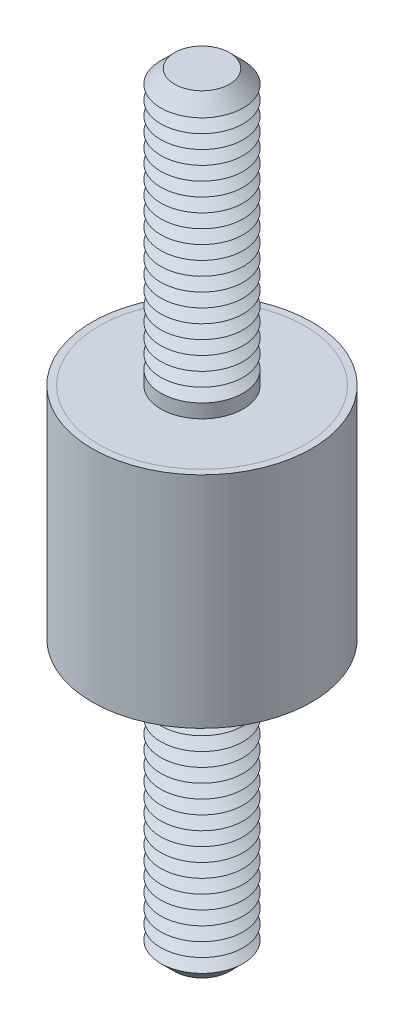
ISO-10303-21;
HEADER;
FILE_DESCRIPTION(('STEP AP214'),'2;1');
FILE_NAME('part.step','',(''),(''),'','','');
FILE_SCHEMA(('AUTOMOTIVE_DESIGN { 1 0 10303 214 1 1 1 1 }'));
ENDSEC;
DATA;
#1=APPLICATION_CONTEXT('core data for automotive mechanical design processes');
#2=APPLICATION_PROTOCOL_DEFINITION('international standard','automotive_design',2000,#1);
#3=PRODUCT_CONTEXT('',#1,'mechanical');
#4=PRODUCT('Part','Part','',(#3));
#5=PRODUCT_RELATED_PRODUCT_CATEGORY('part','',(#4));
#6=PRODUCT_DEFINITION_FORMATION('','',#4);
#7=PRODUCT_DEFINITION_CONTEXT('part definition',#1,'design');
#8=PRODUCT_DEFINITION('design','',#6,#7);
#9=PRODUCT_DEFINITION_SHAPE('','',#8);
#10=(LENGTH_UNIT() NAMED_UNIT(*) SI_UNIT(.MILLI.,.METRE.));
#11=(NAMED_UNIT(*) PLANE_ANGLE_UNIT() SI_UNIT($,.RADIAN.));
#12=(NAMED_UNIT(*) SI_UNIT($,.STERADIAN.) SOLID_ANGLE_UNIT());
#13=UNCERTAINTY_MEASURE_WITH_UNIT(LENGTH_MEASURE(1.E-05),#10,'distance_accuracy_value','');
#14=(GEOMETRIC_REPRESENTATION_CONTEXT(3) GLOBAL_UNCERTAINTY_ASSIGNED_CONTEXT((#13)) GLOBAL_UNIT_ASSIGNED_CONTEXT((#10,
#11,#12)) REPRESENTATION_CONTEXT('',''));
#15=CARTESIAN_POINT('',(0.,0.,0.));
#16=DIRECTION('',(0.,0.,1.));
#17=DIRECTION('',(1.,0.,0.));
#18=AXIS2_PLACEMENT_3D('',#15,#16,#17);
#19=CARTESIAN_POINT('',(0.,-14.,0.));
#20=DIRECTION('',(0.,1.,0.));
#21=DIRECTION('',(0.,0.,1.));
#22=AXIS2_PLACEMENT_3D('',#19,#20,#21);
#23=CYLINDRICAL_SURFACE('',#22,1.5);
#24=CARTESIAN_POINT('',(0.,-4.,0.));
#25=DIRECTION('',(0.,-1.,0.));
#26=DIRECTION('',(0.,0.,-1.));
#27=AXIS2_PLACEMENT_3D('',#24,#25,#26);
#28=CIRCLE('',#27,1.5);
#29=CARTESIAN_POINT('',(0.,-4.,-1.5));
#30=VERTEX_POINT('',#29);
#31=EDGE_CURVE('P0_E21',#30,#30,#28,.T.);
#32=ORIENTED_EDGE('',*,*,#31,.T.);
#33=EDGE_LOOP('',(#32));
#34=FACE_BOUND('',#33,.T.);
#35=CARTESIAN_POINT('',(0.,-4.5,0.));
#36=DIRECTION('',(0.,1.,0.));
#37=DIRECTION('',(0.,0.,1.));
#38=AXIS2_PLACEMENT_3D('',#35,#36,#37);
#39=CIRCLE('',#38,1.5);
#40=CARTESIAN_POINT('',(0.,-4.5,1.5));
#41=VERTEX_POINT('',#40);
#42=EDGE_CURVE('P0_E33',#41,#41,#39,.T.);
#43=ORIENTED_EDGE('',*,*,#42,.T.);
#44=EDGE_LOOP('',(#43));
#45=FACE_BOUND('',#44,.T.);
#46=ADVANCED_FACE('P0_F14',(#34,#45),#23,.T.);
#47=CARTESIAN_POINT('',(0.,-4.,0.));
#48=DIRECTION('',(0.,1.,0.));
#49=DIRECTION('',(0.,0.,1.));
#50=AXIS2_PLACEMENT_3D('',#47,#48,#49);
#51=CYLINDRICAL_SURFACE('',#50,3.75);
#52=CARTESIAN_POINT('',(0.,-4.,0.));
#53=DIRECTION('',(0.,1.,0.));
#54=DIRECTION('',(0.,0.,1.));
#55=AXIS2_PLACEMENT_3D('',#52,#53,#54);
#56=CIRCLE('',#55,3.75);
#57=CARTESIAN_POINT('',(0.,-4.,3.75));
#58=VERTEX_POINT('',#57);
#59=EDGE_CURVE('P0_E25',#58,#58,#56,.T.);
#60=ORIENTED_EDGE('',*,*,#59,.T.);
#61=EDGE_LOOP('',(#60));
#62=FACE_BOUND('',#61,.T.);
#63=CARTESIAN_POINT('',(0.,-3.5,0.));
#64=DIRECTION('',(0.,1.,0.));
#65=DIRECTION('',(0.,0.,1.));
#66=AXIS2_PLACEMENT_3D('',#63,#64,#65);
#67=CIRCLE('',#66,3.75);
#68=CARTESIAN_POINT('',(0.,-3.5,3.75));
#69=VERTEX_POINT('',#68);
#70=EDGE_CURVE('P0_E30',#69,#69,#67,.T.);
#71=ORIENTED_EDGE('',*,*,#70,.F.);
#72=EDGE_LOOP('',(#71));
#73=FACE_BOUND('',#72,.T.);
#74=ADVANCED_FACE('P0_F169',(#62,#73),#51,.T.);
#75=CARTESIAN_POINT('',(0.,-4.,0.));
#76=DIRECTION('',(0.,1.,0.));
#77=DIRECTION('',(0.,0.,1.));
#78=AXIS2_PLACEMENT_3D('',#75,#76,#77);
#79=PLANE('',#78);
#80=ORIENTED_EDGE('',*,*,#31,.F.);
#81=EDGE_LOOP('',(#80));
#82=FACE_BOUND('',#81,.T.);
#83=ORIENTED_EDGE('',*,*,#59,.F.);
#84=EDGE_LOOP('',(#83));
#85=FACE_BOUND('',#84,.T.);
#86=ADVANCED_FACE('P0_F174',(#82,#85),#79,.F.);
#87=CARTESIAN_POINT('',(0.,-3.5,0.));
#88=DIRECTION('',(0.,1.,0.));
#89=DIRECTION('',(0.,0.,1.));
#90=AXIS2_PLACEMENT_3D('',#87,#88,#89);
#91=PLANE('',#90);
#92=ORIENTED_EDGE('',*,*,#70,.T.);
#93=EDGE_LOOP('',(#92));
#94=FACE_BOUND('',#93,.T.);
#95=ADVANCED_FACE('P0_F180',(#94),#91,.T.);
#96=CARTESIAN_POINT('',(0.,-4.5,0.));
#97=DIRECTION('',(0.,1.,0.));
#98=DIRECTION('',(0.,0.,1.));
#99=AXIS2_PLACEMENT_3D('',#96,#97,#98);
#100=CONICAL_SURFACE('',#99,1.5,1.0471975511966);
#101=CARTESIAN_POINT('',(0.,-4.75,0.));
#102=DIRECTION('',(0.,1.,0.));
#103=DIRECTION('',(0.,0.,1.));
#104=AXIS2_PLACEMENT_3D('',#101,#102,#103);
#105=CIRCLE('',#104,1.06698729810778);
#106=CARTESIAN_POINT('',(0.,-4.75,1.06698729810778));
#107=VERTEX_POINT('',#106);
#108=EDGE_CURVE('P0_E39',#107,#107,#105,.T.);
#109=ORIENTED_EDGE('',*,*,#108,.T.);
#110=EDGE_LOOP('',(#109));
#111=FACE_BOUND('',#110,.T.);
#112=ORIENTED_EDGE('',*,*,#42,.F.);
#113=EDGE_LOOP('',(#112));
#114=FACE_BOUND('',#113,.T.);
#115=ADVANCED_FACE('P0_F183',(#111,#114),#100,.T.);
#116=CARTESIAN_POINT('',(0.,-4.75,0.));
#117=DIRECTION('',(0.,-1.,0.));
#118=DIRECTION('',(0.,0.,-1.));
#119=AXIS2_PLACEMENT_3D('',#116,#117,#118);
#120=CONICAL_SURFACE('',#119,1.06698729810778,1.0471975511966);
#121=CARTESIAN_POINT('',(0.,-5.,0.));
#122=DIRECTION('',(0.,1.,0.));
#123=DIRECTION('',(0.,0.,1.));
#124=AXIS2_PLACEMENT_3D('',#121,#122,#123);
#125=CIRCLE('',#124,1.5);
#126=CARTESIAN_POINT('',(0.,-5.,1.5));
#127=VERTEX_POINT('',#126);
#128=EDGE_CURVE('P0_E43',#127,#127,#125,.T.);
#129=ORIENTED_EDGE('',*,*,#128,.T.);
#130=EDGE_LOOP('',(#129));
#131=FACE_BOUND('',#130,.T.);
#132=ORIENTED_EDGE('',*,*,#108,.F.);
#133=EDGE_LOOP('',(#132));
#134=FACE_BOUND('',#133,.T.);
#135=ADVANCED_FACE('P0_F187',(#131,#134),#120,.T.);
#136=CARTESIAN_POINT('',(0.,-5.,0.));
#137=DIRECTION('',(0.,1.,0.));
#138=DIRECTION('',(0.,0.,1.));
#139=AXIS2_PLACEMENT_3D('',#136,#137,#138);
#140=CONICAL_SURFACE('',#139,1.5,1.0471975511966);
#141=CARTESIAN_POINT('',(0.,-5.25,0.));
#142=DIRECTION('',(0.,1.,0.));
#143=DIRECTION('',(0.,0.,1.));
#144=AXIS2_PLACEMENT_3D('',#141,#142,#143);
#145=CIRCLE('',#144,1.06698729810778);
#146=CARTESIAN_POINT('',(0.,-5.25,1.06698729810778));
#147=VERTEX_POINT('',#146);
#148=EDGE_CURVE('P0_E47',#147,#147,#145,.T.);
#149=ORIENTED_EDGE('',*,*,#148,.T.);
#150=EDGE_LOOP('',(#149));
#151=FACE_BOUND('',#150,.T.);
#152=ORIENTED_EDGE('',*,*,#128,.F.);
#153=EDGE_LOOP('',(#152));
#154=FACE_BOUND('',#153,.T.);
#155=ADVANCED_FACE('P0_F191',(#151,#154),#140,.T.);
#156=CARTESIAN_POINT('',(0.,-5.25,0.));
#157=DIRECTION('',(0.,-1.,0.));
#158=DIRECTION('',(0.,0.,-1.));
#159=AXIS2_PLACEMENT_3D('',#156,#157,#158);
#160=CONICAL_SURFACE('',#159,1.06698729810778,1.0471975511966);
#161=CARTESIAN_POINT('',(0.,-5.5,0.));
#162=DIRECTION('',(0.,1.,0.));
#163=DIRECTION('',(0.,0.,1.));
#164=AXIS2_PLACEMENT_3D('',#161,#162,#163);
#165=CIRCLE('',#164,1.5);
#166=CARTESIAN_POINT('',(0.,-5.5,1.5));
#167=VERTEX_POINT('',#166);
#168=EDGE_CURVE('P0_E52',#167,#167,#165,.T.);
#169=ORIENTED_EDGE('',*,*,#168,.T.);
#170=EDGE_LOOP('',(#169));
#171=FACE_BOUND('',#170,.T.);
#172=ORIENTED_EDGE('',*,*,#148,.F.);
#173=EDGE_LOOP('',(#172));
#174=FACE_BOUND('',#173,.T.);
#175=ADVANCED_FACE('P0_F198',(#171,#174),#160,.T.);
#176=CARTESIAN_POINT('',(0.,-5.5,0.));
#177=DIRECTION('',(0.,1.,0.));
#178=DIRECTION('',(0.,0.,1.));
#179=AXIS2_PLACEMENT_3D('',#176,#177,#178);
#180=CONICAL_SURFACE('',#179,1.5,1.0471975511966);
#181=CARTESIAN_POINT('',(0.,-5.75,0.));
#182=DIRECTION('',(0.,1.,0.));
#183=DIRECTION('',(0.,0.,1.));
#184=AXIS2_PLACEMENT_3D('',#181,#182,#183);
#185=CIRCLE('',#184,1.06698729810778);
#186=CARTESIAN_POINT('',(0.,-5.75,1.06698729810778));
#187=VERTEX_POINT('',#186);
#188=EDGE_CURVE('P0_E55',#187,#187,#185,.T.);
#189=ORIENTED_EDGE('',*,*,#188,.T.);
#190=EDGE_LOOP('',(#189));
#191=FACE_BOUND('',#190,.T.);
#192=ORIENTED_EDGE('',*,*,#168,.F.);
#193=EDGE_LOOP('',(#192));
#194=FACE_BOUND('',#193,.T.);
#195=ADVANCED_FACE('P0_F202',(#191,#194),#180,.T.);
#196=CARTESIAN_POINT('',(0.,-5.75,0.));
#197=DIRECTION('',(0.,-1.,0.));
#198=DIRECTION('',(0.,0.,-1.));
#199=AXIS2_PLACEMENT_3D('',#196,#197,#198);
#200=CONICAL_SURFACE('',#199,1.06698729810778,1.0471975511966);
#201=CARTESIAN_POINT('',(0.,-6.,0.));
#202=DIRECTION('',(0.,1.,0.));
#203=DIRECTION('',(0.,0.,1.));
#204=AXIS2_PLACEMENT_3D('',#201,#202,#203);
#205=CIRCLE('',#204,1.5);
#206=CARTESIAN_POINT('',(0.,-6.,1.5));
#207=VERTEX_POINT('',#206);
#208=EDGE_CURVE('P0_E58',#207,#207,#205,.T.);
#209=ORIENTED_EDGE('',*,*,#208,.T.);
#210=EDGE_LOOP('',(#209));
#211=FACE_BOUND('',#210,.T.);
#212=ORIENTED_EDGE('',*,*,#188,.F.);
#213=EDGE_LOOP('',(#212));
#214=FACE_BOUND('',#213,.T.);
#215=ADVANCED_FACE('P0_F206',(#211,#214),#200,.T.);
#216=CARTESIAN_POINT('',(0.,-6.,0.));
#217=DIRECTION('',(0.,1.,0.));
#218=DIRECTION('',(0.,0.,1.));
#219=AXIS2_PLACEMENT_3D('',#216,#217,#218);
#220=CONICAL_SURFACE('',#219,1.5,1.0471975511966);
#221=CARTESIAN_POINT('',(0.,-6.25,0.));
#222=DIRECTION('',(0.,1.,0.));
#223=DIRECTION('',(0.,0.,1.));
#224=AXIS2_PLACEMENT_3D('',#221,#222,#223);
#225=CIRCLE('',#224,1.06698729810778);
#226=CARTESIAN_POINT('',(0.,-6.25,1.06698729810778));
#227=VERTEX_POINT('',#226);
#228=EDGE_CURVE('P0_E61',#227,#227,#225,.T.);
#229=ORIENTED_EDGE('',*,*,#228,.T.);
#230=EDGE_LOOP('',(#229));
#231=FACE_BOUND('',#230,.T.);
#232=ORIENTED_EDGE('',*,*,#208,.F.);
#233=EDGE_LOOP('',(#232));
#234=FACE_BOUND('',#233,.T.);
#235=ADVANCED_FACE('P0_F210',(#231,#234),#220,.T.);
#236=CARTESIAN_POINT('',(0.,-6.25,0.));
#237=DIRECTION('',(0.,-1.,0.));
#238=DIRECTION('',(0.,0.,-1.));
#239=AXIS2_PLACEMENT_3D('',#236,#237,#238);
#240=CONICAL_SURFACE('',#239,1.06698729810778,1.0471975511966);
#241=CARTESIAN_POINT('',(0.,-6.5,0.));
#242=DIRECTION('',(0.,1.,0.));
#243=DIRECTION('',(0.,0.,1.));
#244=AXIS2_PLACEMENT_3D('',#241,#242,#243);
#245=CIRCLE('',#244,1.5);
#246=CARTESIAN_POINT('',(0.,-6.5,1.5));
#247=VERTEX_POINT('',#246);
#248=EDGE_CURVE('P0_E64',#247,#247,#245,.T.);
#249=ORIENTED_EDGE('',*,*,#248,.T.);
#250=EDGE_LOOP('',(#249));
#251=FACE_BOUND('',#250,.T.);
#252=ORIENTED_EDGE('',*,*,#228,.F.);
#253=EDGE_LOOP('',(#252));
#254=FACE_BOUND('',#253,.T.);
#255=ADVANCED_FACE('P0_F214',(#251,#254),#240,.T.);
#256=CARTESIAN_POINT('',(0.,-6.5,0.));
#257=DIRECTION('',(0.,1.,0.));
#258=DIRECTION('',(0.,0.,1.));
#259=AXIS2_PLACEMENT_3D('',#256,#257,#258);
#260=CONICAL_SURFACE('',#259,1.5,1.0471975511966);
#261=CARTESIAN_POINT('',(0.,-6.75,0.));
#262=DIRECTION('',(0.,1.,0.));
#263=DIRECTION('',(0.,0.,1.));
#264=AXIS2_PLACEMENT_3D('',#261,#262,#263);
#265=CIRCLE('',#264,1.06698729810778);
#266=CARTESIAN_POINT('',(0.,-6.75,1.06698729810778));
#267=VERTEX_POINT('',#266);
#268=EDGE_CURVE('P0_E67',#267,#267,#265,.T.);
#269=ORIENTED_EDGE('',*,*,#268,.T.);
#270=EDGE_LOOP('',(#269));
#271=FACE_BOUND('',#270,.T.);
#272=ORIENTED_EDGE('',*,*,#248,.F.);
#273=EDGE_LOOP('',(#272));
#274=FACE_BOUND('',#273,.T.);
#275=ADVANCED_FACE('P0_F218',(#271,#274),#260,.T.);
#276=CARTESIAN_POINT('',(0.,-6.75,0.));
#277=DIRECTION('',(0.,-1.,0.));
#278=DIRECTION('',(0.,0.,-1.));
#279=AXIS2_PLACEMENT_3D('',#276,#277,#278);
#280=CONICAL_SURFACE('',#279,1.06698729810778,1.0471975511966);
#281=CARTESIAN_POINT('',(0.,-7.,0.));
#282=DIRECTION('',(0.,1.,0.));
#283=DIRECTION('',(0.,0.,1.));
#284=AXIS2_PLACEMENT_3D('',#281,#282,#283);
#285=CIRCLE('',#284,1.5);
#286=CARTESIAN_POINT('',(0.,-7.,1.5));
#287=VERTEX_POINT('',#286);
#288=EDGE_CURVE('P0_E70',#287,#287,#285,.T.);
#289=ORIENTED_EDGE('',*,*,#288,.T.);
#290=EDGE_LOOP('',(#289));
#291=FACE_BOUND('',#290,.T.);
#292=ORIENTED_EDGE('',*,*,#268,.F.);
#293=EDGE_LOOP('',(#292));
#294=FACE_BOUND('',#293,.T.);
#295=ADVANCED_FACE('P0_F222',(#291,#294),#280,.T.);
#296=CARTESIAN_POINT('',(0.,-7.,0.));
#297=DIRECTION('',(0.,1.,0.));
#298=DIRECTION('',(0.,0.,1.));
#299=AXIS2_PLACEMENT_3D('',#296,#297,#298);
#300=CONICAL_SURFACE('',#299,1.5,1.0471975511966);
#301=CARTESIAN_POINT('',(0.,-7.25,0.));
#302=DIRECTION('',(0.,1.,0.));
#303=DIRECTION('',(0.,0.,1.));
#304=AXIS2_PLACEMENT_3D('',#301,#302,#303);
#305=CIRCLE('',#304,1.06698729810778);
#306=CARTESIAN_POINT('',(0.,-7.25,1.06698729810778));
#307=VERTEX_POINT('',#306);
#308=EDGE_CURVE('P0_E73',#307,#307,#305,.T.);
#309=ORIENTED_EDGE('',*,*,#308,.T.);
#310=EDGE_LOOP('',(#309));
#311=FACE_BOUND('',#310,.T.);
#312=ORIENTED_EDGE('',*,*,#288,.F.);
#313=EDGE_LOOP('',(#312));
#314=FACE_BOUND('',#313,.T.);
#315=ADVANCED_FACE('P0_F226',(#311,#314),#300,.T.);
#316=CARTESIAN_POINT('',(0.,-7.25,0.));
#317=DIRECTION('',(0.,-1.,0.));
#318=DIRECTION('',(0.,0.,-1.));
#319=AXIS2_PLACEMENT_3D('',#316,#317,#318);
#320=CONICAL_SURFACE('',#319,1.06698729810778,1.0471975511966);
#321=CARTESIAN_POINT('',(0.,-7.5,0.));
#322=DIRECTION('',(0.,1.,0.));
#323=DIRECTION('',(0.,0.,1.));
#324=AXIS2_PLACEMENT_3D('',#321,#322,#323);
#325=CIRCLE('',#324,1.5);
#326=CARTESIAN_POINT('',(0.,-7.5,1.5));
#327=VERTEX_POINT('',#326);
#328=EDGE_CURVE('P0_E76',#327,#327,#325,.T.);
#329=ORIENTED_EDGE('',*,*,#328,.T.);
#330=EDGE_LOOP('',(#329));
#331=FACE_BOUND('',#330,.T.);
#332=ORIENTED_EDGE('',*,*,#308,.F.);
#333=EDGE_LOOP('',(#332));
#334=FACE_BOUND('',#333,.T.);
#335=ADVANCED_FACE('P0_F230',(#331,#334),#320,.T.);
#336=CARTESIAN_POINT('',(0.,-7.5,0.));
#337=DIRECTION('',(0.,1.,0.));
#338=DIRECTION('',(0.,0.,1.));
#339=AXIS2_PLACEMENT_3D('',#336,#337,#338);
#340=CONICAL_SURFACE('',#339,1.5,1.0471975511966);
#341=CARTESIAN_POINT('',(0.,-7.75,0.));
#342=DIRECTION('',(0.,1.,0.));
#343=DIRECTION('',(0.,0.,1.));
#344=AXIS2_PLACEMENT_3D('',#341,#342,#343);
#345=CIRCLE('',#344,1.06698729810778);
#346=CARTESIAN_POINT('',(0.,-7.75,1.06698729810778));
#347=VERTEX_POINT('',#346);
#348=EDGE_CURVE('P0_E79',#347,#347,#345,.T.);
#349=ORIENTED_EDGE('',*,*,#348,.T.);
#350=EDGE_LOOP('',(#349));
#351=FACE_BOUND('',#350,.T.);
#352=ORIENTED_EDGE('',*,*,#328,.F.);
#353=EDGE_LOOP('',(#352));
#354=FACE_BOUND('',#353,.T.);
#355=ADVANCED_FACE('P0_F234',(#351,#354),#340,.T.);
#356=CARTESIAN_POINT('',(0.,-7.75,0.));
#357=DIRECTION('',(0.,-1.,0.));
#358=DIRECTION('',(0.,0.,-1.));
#359=AXIS2_PLACEMENT_3D('',#356,#357,#358);
#360=CONICAL_SURFACE('',#359,1.06698729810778,1.0471975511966);
#361=CARTESIAN_POINT('',(0.,-8.,0.));
#362=DIRECTION('',(0.,1.,0.));
#363=DIRECTION('',(0.,0.,1.));
#364=AXIS2_PLACEMENT_3D('',#361,#362,#363);
#365=CIRCLE('',#364,1.5);
#366=CARTESIAN_POINT('',(0.,-8.,1.5));
#367=VERTEX_POINT('',#366);
#368=EDGE_CURVE('P0_E82',#367,#367,#365,.T.);
#369=ORIENTED_EDGE('',*,*,#368,.T.);
#370=EDGE_LOOP('',(#369));
#371=FACE_BOUND('',#370,.T.);
#372=ORIENTED_EDGE('',*,*,#348,.F.);
#373=EDGE_LOOP('',(#372));
#374=FACE_BOUND('',#373,.T.);
#375=ADVANCED_FACE('P0_F238',(#371,#374),#360,.T.);
#376=CARTESIAN_POINT('',(0.,-8.,0.));
#377=DIRECTION('',(0.,1.,0.));
#378=DIRECTION('',(0.,0.,1.));
#379=AXIS2_PLACEMENT_3D('',#376,#377,#378);
#380=CONICAL_SURFACE('',#379,1.5,1.0471975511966);
#381=CARTESIAN_POINT('',(0.,-8.25,0.));
#382=DIRECTION('',(0.,1.,0.));
#383=DIRECTION('',(0.,0.,1.));
#384=AXIS2_PLACEMENT_3D('',#381,#382,#383);
#385=CIRCLE('',#384,1.06698729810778);
#386=CARTESIAN_POINT('',(0.,-8.25,1.06698729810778));
#387=VERTEX_POINT('',#386);
#388=EDGE_CURVE('P0_E85',#387,#387,#385,.T.);
#389=ORIENTED_EDGE('',*,*,#388,.T.);
#390=EDGE_LOOP('',(#389));
#391=FACE_BOUND('',#390,.T.);
#392=ORIENTED_EDGE('',*,*,#368,.F.);
#393=EDGE_LOOP('',(#392));
#394=FACE_BOUND('',#393,.T.);
#395=ADVANCED_FACE('P0_F242',(#391,#394),#380,.T.);
#396=CARTESIAN_POINT('',(0.,-8.25,0.));
#397=DIRECTION('',(0.,-1.,0.));
#398=DIRECTION('',(0.,0.,-1.));
#399=AXIS2_PLACEMENT_3D('',#396,#397,#398);
#400=CONICAL_SURFACE('',#399,1.06698729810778,1.0471975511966);
#401=CARTESIAN_POINT('',(0.,-8.5,0.));
#402=DIRECTION('',(0.,1.,0.));
#403=DIRECTION('',(0.,0.,1.));
#404=AXIS2_PLACEMENT_3D('',#401,#402,#403);
#405=CIRCLE('',#404,1.5);
#406=CARTESIAN_POINT('',(0.,-8.5,1.5));
#407=VERTEX_POINT('',#406);
#408=EDGE_CURVE('P0_E88',#407,#407,#405,.T.);
#409=ORIENTED_EDGE('',*,*,#408,.T.);
#410=EDGE_LOOP('',(#409));
#411=FACE_BOUND('',#410,.T.);
#412=ORIENTED_EDGE('',*,*,#388,.F.);
#413=EDGE_LOOP('',(#412));
#414=FACE_BOUND('',#413,.T.);
#415=ADVANCED_FACE('P0_F246',(#411,#414),#400,.T.);
#416=CARTESIAN_POINT('',(0.,-8.5,0.));
#417=DIRECTION('',(0.,1.,0.));
#418=DIRECTION('',(0.,0.,1.));
#419=AXIS2_PLACEMENT_3D('',#416,#417,#418);
#420=CONICAL_SURFACE('',#419,1.5,1.0471975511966);
#421=CARTESIAN_POINT('',(0.,-8.75,0.));
#422=DIRECTION('',(0.,1.,0.));
#423=DIRECTION('',(0.,0.,1.));
#424=AXIS2_PLACEMENT_3D('',#421,#422,#423);
#425=CIRCLE('',#424,1.06698729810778);
#426=CARTESIAN_POINT('',(0.,-8.75,1.06698729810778));
#427=VERTEX_POINT('',#426);
#428=EDGE_CURVE('P0_E91',#427,#427,#425,.T.);
#429=ORIENTED_EDGE('',*,*,#428,.T.);
#430=EDGE_LOOP('',(#429));
#431=FACE_BOUND('',#430,.T.);
#432=ORIENTED_EDGE('',*,*,#408,.F.);
#433=EDGE_LOOP('',(#432));
#434=FACE_BOUND('',#433,.T.);
#435=ADVANCED_FACE('P0_F250',(#431,#434),#420,.T.);
#436=CARTESIAN_POINT('',(0.,-8.75,0.));
#437=DIRECTION('',(0.,-1.,0.));
#438=DIRECTION('',(0.,0.,-1.));
#439=AXIS2_PLACEMENT_3D('',#436,#437,#438);
#440=CONICAL_SURFACE('',#439,1.06698729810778,1.0471975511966);
#441=CARTESIAN_POINT('',(0.,-9.,0.));
#442=DIRECTION('',(0.,1.,0.));
#443=DIRECTION('',(0.,0.,1.));
#444=AXIS2_PLACEMENT_3D('',#441,#442,#443);
#445=CIRCLE('',#444,1.5);
#446=CARTESIAN_POINT('',(0.,-9.,1.5));
#447=VERTEX_POINT('',#446);
#448=EDGE_CURVE('P0_E94',#447,#447,#445,.T.);
#449=ORIENTED_EDGE('',*,*,#448,.T.);
#450=EDGE_LOOP('',(#449));
#451=FACE_BOUND('',#450,.T.);
#452=ORIENTED_EDGE('',*,*,#428,.F.);
#453=EDGE_LOOP('',(#452));
#454=FACE_BOUND('',#453,.T.);
#455=ADVANCED_FACE('P0_F254',(#451,#454),#440,.T.);
#456=CARTESIAN_POINT('',(0.,-9.,0.));
#457=DIRECTION('',(0.,1.,0.));
#458=DIRECTION('',(0.,0.,1.));
#459=AXIS2_PLACEMENT_3D('',#456,#457,#458);
#460=CONICAL_SURFACE('',#459,1.5,1.0471975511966);
#461=CARTESIAN_POINT('',(0.,-9.25,0.));
#462=DIRECTION('',(0.,1.,0.));
#463=DIRECTION('',(0.,0.,1.));
#464=AXIS2_PLACEMENT_3D('',#461,#462,#463);
#465=CIRCLE('',#464,1.06698729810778);
#466=CARTESIAN_POINT('',(0.,-9.25,1.06698729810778));
#467=VERTEX_POINT('',#466);
#468=EDGE_CURVE('P0_E97',#467,#467,#465,.T.);
#469=ORIENTED_EDGE('',*,*,#468,.T.);
#470=EDGE_LOOP('',(#469));
#471=FACE_BOUND('',#470,.T.);
#472=ORIENTED_EDGE('',*,*,#448,.F.);
#473=EDGE_LOOP('',(#472));
#474=FACE_BOUND('',#473,.T.);
#475=ADVANCED_FACE('P0_F258',(#471,#474),#460,.T.);
#476=CARTESIAN_POINT('',(0.,-9.25,0.));
#477=DIRECTION('',(0.,-1.,0.));
#478=DIRECTION('',(0.,0.,-1.));
#479=AXIS2_PLACEMENT_3D('',#476,#477,#478);
#480=CONICAL_SURFACE('',#479,1.06698729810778,1.0471975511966);
#481=CARTESIAN_POINT('',(0.,-9.5,0.));
#482=DIRECTION('',(0.,1.,0.));
#483=DIRECTION('',(0.,0.,1.));
#484=AXIS2_PLACEMENT_3D('',#481,#482,#483);
#485=CIRCLE('',#484,1.5);
#486=CARTESIAN_POINT('',(0.,-9.5,1.5));
#487=VERTEX_POINT('',#486);
#488=EDGE_CURVE('P0_E100',#487,#487,#485,.T.);
#489=ORIENTED_EDGE('',*,*,#488,.T.);
#490=EDGE_LOOP('',(#489));
#491=FACE_BOUND('',#490,.T.);
#492=ORIENTED_EDGE('',*,*,#468,.F.);
#493=EDGE_LOOP('',(#492));
#494=FACE_BOUND('',#493,.T.);
#495=ADVANCED_FACE('P0_F262',(#491,#494),#480,.T.);
#496=CARTESIAN_POINT('',(0.,-9.5,0.));
#497=DIRECTION('',(0.,1.,0.));
#498=DIRECTION('',(0.,0.,1.));
#499=AXIS2_PLACEMENT_3D('',#496,#497,#498);
#500=CONICAL_SURFACE('',#499,1.5,1.0471975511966);
#501=CARTESIAN_POINT('',(0.,-9.75,0.));
#502=DIRECTION('',(0.,1.,0.));
#503=DIRECTION('',(0.,0.,1.));
#504=AXIS2_PLACEMENT_3D('',#501,#502,#503);
#505=CIRCLE('',#504,1.06698729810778);
#506=CARTESIAN_POINT('',(0.,-9.75,1.06698729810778));
#507=VERTEX_POINT('',#506);
#508=EDGE_CURVE('P0_E103',#507,#507,#505,.T.);
#509=ORIENTED_EDGE('',*,*,#508,.T.);
#510=EDGE_LOOP('',(#509));
#511=FACE_BOUND('',#510,.T.);
#512=ORIENTED_EDGE('',*,*,#488,.F.);
#513=EDGE_LOOP('',(#512));
#514=FACE_BOUND('',#513,.T.);
#515=ADVANCED_FACE('P0_F266',(#511,#514),#500,.T.);
#516=CARTESIAN_POINT('',(0.,-9.75,0.));
#517=DIRECTION('',(0.,-1.,0.));
#518=DIRECTION('',(0.,0.,-1.));
#519=AXIS2_PLACEMENT_3D('',#516,#517,#518);
#520=CONICAL_SURFACE('',#519,1.06698729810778,1.0471975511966);
#521=CARTESIAN_POINT('',(0.,-10.,0.));
#522=DIRECTION('',(0.,1.,0.));
#523=DIRECTION('',(0.,0.,1.));
#524=AXIS2_PLACEMENT_3D('',#521,#522,#523);
#525=CIRCLE('',#524,1.5);
#526=CARTESIAN_POINT('',(0.,-10.,1.5));
#527=VERTEX_POINT('',#526);
#528=EDGE_CURVE('P0_E106',#527,#527,#525,.T.);
#529=ORIENTED_EDGE('',*,*,#528,.T.);
#530=EDGE_LOOP('',(#529));
#531=FACE_BOUND('',#530,.T.);
#532=ORIENTED_EDGE('',*,*,#508,.F.);
#533=EDGE_LOOP('',(#532));
#534=FACE_BOUND('',#533,.T.);
#535=ADVANCED_FACE('P0_F270',(#531,#534),#520,.T.);
#536=CARTESIAN_POINT('',(0.,-10.,0.));
#537=DIRECTION('',(0.,1.,0.));
#538=DIRECTION('',(0.,0.,1.));
#539=AXIS2_PLACEMENT_3D('',#536,#537,#538);
#540=CONICAL_SURFACE('',#539,1.5,1.0471975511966);
#541=CARTESIAN_POINT('',(0.,-10.25,0.));
#542=DIRECTION('',(0.,1.,0.));
#543=DIRECTION('',(0.,0.,1.));
#544=AXIS2_PLACEMENT_3D('',#541,#542,#543);
#545=CIRCLE('',#544,1.06698729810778);
#546=CARTESIAN_POINT('',(0.,-10.25,1.06698729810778));
#547=VERTEX_POINT('',#546);
#548=EDGE_CURVE('P0_E109',#547,#547,#545,.T.);
#549=ORIENTED_EDGE('',*,*,#548,.T.);
#550=EDGE_LOOP('',(#549));
#551=FACE_BOUND('',#550,.T.);
#552=ORIENTED_EDGE('',*,*,#528,.F.);
#553=EDGE_LOOP('',(#552));
#554=FACE_BOUND('',#553,.T.);
#555=ADVANCED_FACE('P0_F274',(#551,#554),#540,.T.);
#556=CARTESIAN_POINT('',(0.,-10.25,0.));
#557=DIRECTION('',(0.,-1.,0.));
#558=DIRECTION('',(0.,0.,-1.));
#559=AXIS2_PLACEMENT_3D('',#556,#557,#558);
#560=CONICAL_SURFACE('',#559,1.06698729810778,1.0471975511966);
#561=CARTESIAN_POINT('',(0.,-10.5,0.));
#562=DIRECTION('',(0.,1.,0.));
#563=DIRECTION('',(0.,0.,1.));
#564=AXIS2_PLACEMENT_3D('',#561,#562,#563);
#565=CIRCLE('',#564,1.5);
#566=CARTESIAN_POINT('',(0.,-10.5,1.5));
#567=VERTEX_POINT('',#566);
#568=EDGE_CURVE('P0_E112',#567,#567,#565,.T.);
#569=ORIENTED_EDGE('',*,*,#568,.T.);
#570=EDGE_LOOP('',(#569));
#571=FACE_BOUND('',#570,.T.);
#572=ORIENTED_EDGE('',*,*,#548,.F.);
#573=EDGE_LOOP('',(#572));
#574=FACE_BOUND('',#573,.T.);
#575=ADVANCED_FACE('P0_F278',(#571,#574),#560,.T.);
#576=CARTESIAN_POINT('',(0.,-10.5,0.));
#577=DIRECTION('',(0.,1.,0.));
#578=DIRECTION('',(0.,0.,1.));
#579=AXIS2_PLACEMENT_3D('',#576,#577,#578);
#580=CONICAL_SURFACE('',#579,1.5,1.0471975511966);
#581=CARTESIAN_POINT('',(0.,-10.75,0.));
#582=DIRECTION('',(0.,1.,0.));
#583=DIRECTION('',(0.,0.,1.));
#584=AXIS2_PLACEMENT_3D('',#581,#582,#583);
#585=CIRCLE('',#584,1.06698729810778);
#586=CARTESIAN_POINT('',(0.,-10.75,1.06698729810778));
#587=VERTEX_POINT('',#586);
#588=EDGE_CURVE('P0_E115',#587,#587,#585,.T.);
#589=ORIENTED_EDGE('',*,*,#588,.T.);
#590=EDGE_LOOP('',(#589));
#591=FACE_BOUND('',#590,.T.);
#592=ORIENTED_EDGE('',*,*,#568,.F.);
#593=EDGE_LOOP('',(#592));
#594=FACE_BOUND('',#593,.T.);
#595=ADVANCED_FACE('P0_F282',(#591,#594),#580,.T.);
#596=CARTESIAN_POINT('',(0.,-10.75,0.));
#597=DIRECTION('',(0.,-1.,0.));
#598=DIRECTION('',(0.,0.,-1.));
#599=AXIS2_PLACEMENT_3D('',#596,#597,#598);
#600=CONICAL_SURFACE('',#599,1.06698729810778,1.0471975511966);
#601=CARTESIAN_POINT('',(0.,-11.,0.));
#602=DIRECTION('',(0.,1.,0.));
#603=DIRECTION('',(0.,0.,1.));
#604=AXIS2_PLACEMENT_3D('',#601,#602,#603);
#605=CIRCLE('',#604,1.5);
#606=CARTESIAN_POINT('',(0.,-11.,1.5));
#607=VERTEX_POINT('',#606);
#608=EDGE_CURVE('P0_E118',#607,#607,#605,.T.);
#609=ORIENTED_EDGE('',*,*,#608,.T.);
#610=EDGE_LOOP('',(#609));
#611=FACE_BOUND('',#610,.T.);
#612=ORIENTED_EDGE('',*,*,#588,.F.);
#613=EDGE_LOOP('',(#612));
#614=FACE_BOUND('',#613,.T.);
#615=ADVANCED_FACE('P0_F286',(#611,#614),#600,.T.);
#616=CARTESIAN_POINT('',(0.,-11.,0.));
#617=DIRECTION('',(0.,1.,0.));
#618=DIRECTION('',(0.,0.,1.));
#619=AXIS2_PLACEMENT_3D('',#616,#617,#618);
#620=CONICAL_SURFACE('',#619,1.5,1.0471975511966);
#621=CARTESIAN_POINT('',(0.,-11.25,0.));
#622=DIRECTION('',(0.,1.,0.));
#623=DIRECTION('',(0.,0.,1.));
#624=AXIS2_PLACEMENT_3D('',#621,#622,#623);
#625=CIRCLE('',#624,1.06698729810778);
#626=CARTESIAN_POINT('',(0.,-11.25,1.06698729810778));
#627=VERTEX_POINT('',#626);
#628=EDGE_CURVE('P0_E121',#627,#627,#625,.T.);
#629=ORIENTED_EDGE('',*,*,#628,.T.);
#630=EDGE_LOOP('',(#629));
#631=FACE_BOUND('',#630,.T.);
#632=ORIENTED_EDGE('',*,*,#608,.F.);
#633=EDGE_LOOP('',(#632));
#634=FACE_BOUND('',#633,.T.);
#635=ADVANCED_FACE('P0_F290',(#631,#634),#620,.T.);
#636=CARTESIAN_POINT('',(0.,-11.25,0.));
#637=DIRECTION('',(0.,-1.,0.));
#638=DIRECTION('',(0.,0.,-1.));
#639=AXIS2_PLACEMENT_3D('',#636,#637,#638);
#640=CONICAL_SURFACE('',#639,1.06698729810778,1.0471975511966);
#641=CARTESIAN_POINT('',(0.,-11.5,0.));
#642=DIRECTION('',(0.,1.,0.));
#643=DIRECTION('',(0.,0.,1.));
#644=AXIS2_PLACEMENT_3D('',#641,#642,#643);
#645=CIRCLE('',#644,1.5);
#646=CARTESIAN_POINT('',(0.,-11.5,1.5));
#647=VERTEX_POINT('',#646);
#648=EDGE_CURVE('P0_E124',#647,#647,#645,.T.);
#649=ORIENTED_EDGE('',*,*,#648,.T.);
#650=EDGE_LOOP('',(#649));
#651=FACE_BOUND('',#650,.T.);
#652=ORIENTED_EDGE('',*,*,#628,.F.);
#653=EDGE_LOOP('',(#652));
#654=FACE_BOUND('',#653,.T.);
#655=ADVANCED_FACE('P0_F294',(#651,#654),#640,.T.);
#656=CARTESIAN_POINT('',(0.,-11.5,0.));
#657=DIRECTION('',(0.,1.,0.));
#658=DIRECTION('',(0.,0.,1.));
#659=AXIS2_PLACEMENT_3D('',#656,#657,#658);
#660=CONICAL_SURFACE('',#659,1.5,1.0471975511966);
#661=CARTESIAN_POINT('',(0.,-11.75,0.));
#662=DIRECTION('',(0.,1.,0.));
#663=DIRECTION('',(0.,0.,1.));
#664=AXIS2_PLACEMENT_3D('',#661,#662,#663);
#665=CIRCLE('',#664,1.06698729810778);
#666=CARTESIAN_POINT('',(0.,-11.75,1.06698729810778));
#667=VERTEX_POINT('',#666);
#668=EDGE_CURVE('P0_E127',#667,#667,#665,.T.);
#669=ORIENTED_EDGE('',*,*,#668,.T.);
#670=EDGE_LOOP('',(#669));
#671=FACE_BOUND('',#670,.T.);
#672=ORIENTED_EDGE('',*,*,#648,.F.);
#673=EDGE_LOOP('',(#672));
#674=FACE_BOUND('',#673,.T.);
#675=ADVANCED_FACE('P0_F298',(#671,#674),#660,.T.);
#676=CARTESIAN_POINT('',(0.,-11.75,0.));
#677=DIRECTION('',(0.,-1.,0.));
#678=DIRECTION('',(0.,0.,-1.));
#679=AXIS2_PLACEMENT_3D('',#676,#677,#678);
#680=CONICAL_SURFACE('',#679,1.06698729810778,1.0471975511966);
#681=CARTESIAN_POINT('',(0.,-12.,0.));
#682=DIRECTION('',(0.,1.,0.));
#683=DIRECTION('',(0.,0.,1.));
#684=AXIS2_PLACEMENT_3D('',#681,#682,#683);
#685=CIRCLE('',#684,1.5);
#686=CARTESIAN_POINT('',(0.,-12.,1.5));
#687=VERTEX_POINT('',#686);
#688=EDGE_CURVE('P0_E130',#687,#687,#685,.T.);
#689=ORIENTED_EDGE('',*,*,#688,.T.);
#690=EDGE_LOOP('',(#689));
#691=FACE_BOUND('',#690,.T.);
#692=ORIENTED_EDGE('',*,*,#668,.F.);
#693=EDGE_LOOP('',(#692));
#694=FACE_BOUND('',#693,.T.);
#695=ADVANCED_FACE('P0_F302',(#691,#694),#680,.T.);
#696=CARTESIAN_POINT('',(0.,-12.,0.));
#697=DIRECTION('',(0.,1.,0.));
#698=DIRECTION('',(0.,0.,1.));
#699=AXIS2_PLACEMENT_3D('',#696,#697,#698);
#700=CONICAL_SURFACE('',#699,1.5,1.0471975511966);
#701=CARTESIAN_POINT('',(0.,-12.25,0.));
#702=DIRECTION('',(0.,1.,0.));
#703=DIRECTION('',(0.,0.,1.));
#704=AXIS2_PLACEMENT_3D('',#701,#702,#703);
#705=CIRCLE('',#704,1.06698729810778);
#706=CARTESIAN_POINT('',(0.,-12.25,1.06698729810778));
#707=VERTEX_POINT('',#706);
#708=EDGE_CURVE('P0_E133',#707,#707,#705,.T.);
#709=ORIENTED_EDGE('',*,*,#708,.T.);
#710=EDGE_LOOP('',(#709));
#711=FACE_BOUND('',#710,.T.);
#712=ORIENTED_EDGE('',*,*,#688,.F.);
#713=EDGE_LOOP('',(#712));
#714=FACE_BOUND('',#713,.T.);
#715=ADVANCED_FACE('P0_F306',(#711,#714),#700,.T.);
#716=CARTESIAN_POINT('',(0.,-12.25,0.));
#717=DIRECTION('',(0.,-1.,0.));
#718=DIRECTION('',(0.,0.,-1.));
#719=AXIS2_PLACEMENT_3D('',#716,#717,#718);
#720=CONICAL_SURFACE('',#719,1.06698729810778,1.0471975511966);
#721=CARTESIAN_POINT('',(0.,-12.5,0.));
#722=DIRECTION('',(0.,1.,0.));
#723=DIRECTION('',(0.,0.,1.));
#724=AXIS2_PLACEMENT_3D('',#721,#722,#723);
#725=CIRCLE('',#724,1.5);
#726=CARTESIAN_POINT('',(0.,-12.5,1.5));
#727=VERTEX_POINT('',#726);
#728=EDGE_CURVE('P0_E136',#727,#727,#725,.T.);
#729=ORIENTED_EDGE('',*,*,#728,.T.);
#730=EDGE_LOOP('',(#729));
#731=FACE_BOUND('',#730,.T.);
#732=ORIENTED_EDGE('',*,*,#708,.F.);
#733=EDGE_LOOP('',(#732));
#734=FACE_BOUND('',#733,.T.);
#735=ADVANCED_FACE('P0_F310',(#731,#734),#720,.T.);
#736=CARTESIAN_POINT('',(0.,-12.5,0.));
#737=DIRECTION('',(0.,1.,0.));
#738=DIRECTION('',(0.,0.,1.));
#739=AXIS2_PLACEMENT_3D('',#736,#737,#738);
#740=CONICAL_SURFACE('',#739,1.5,1.0471975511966);
#741=CARTESIAN_POINT('',(0.,-12.75,0.));
#742=DIRECTION('',(0.,1.,0.));
#743=DIRECTION('',(0.,0.,1.));
#744=AXIS2_PLACEMENT_3D('',#741,#742,#743);
#745=CIRCLE('',#744,1.06698729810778);
#746=CARTESIAN_POINT('',(0.,-12.75,1.06698729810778));
#747=VERTEX_POINT('',#746);
#748=EDGE_CURVE('P0_E139',#747,#747,#745,.T.);
#749=ORIENTED_EDGE('',*,*,#748,.T.);
#750=EDGE_LOOP('',(#749));
#751=FACE_BOUND('',#750,.T.);
#752=ORIENTED_EDGE('',*,*,#728,.F.);
#753=EDGE_LOOP('',(#752));
#754=FACE_BOUND('',#753,.T.);
#755=ADVANCED_FACE('P0_F314',(#751,#754),#740,.T.);
#756=CARTESIAN_POINT('',(0.,-12.75,0.));
#757=DIRECTION('',(0.,-1.,0.));
#758=DIRECTION('',(0.,0.,-1.));
#759=AXIS2_PLACEMENT_3D('',#756,#757,#758);
#760=CONICAL_SURFACE('',#759,1.06698729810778,1.0471975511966);
#761=CARTESIAN_POINT('',(0.,-13.,0.));
#762=DIRECTION('',(0.,1.,0.));
#763=DIRECTION('',(0.,0.,1.));
#764=AXIS2_PLACEMENT_3D('',#761,#762,#763);
#765=CIRCLE('',#764,1.5);
#766=CARTESIAN_POINT('',(0.,-13.,1.5));
#767=VERTEX_POINT('',#766);
#768=EDGE_CURVE('P0_E142',#767,#767,#765,.T.);
#769=ORIENTED_EDGE('',*,*,#768,.T.);
#770=EDGE_LOOP('',(#769));
#771=FACE_BOUND('',#770,.T.);
#772=ORIENTED_EDGE('',*,*,#748,.F.);
#773=EDGE_LOOP('',(#772));
#774=FACE_BOUND('',#773,.T.);
#775=ADVANCED_FACE('P0_F166',(#771,#774),#760,.T.);
#776=CARTESIAN_POINT('',(0.,-13.,0.));
#777=DIRECTION('',(0.,1.,0.));
#778=DIRECTION('',(0.,0.,1.));
#779=AXIS2_PLACEMENT_3D('',#776,#777,#778);
#780=CONICAL_SURFACE('',#779,1.5,1.0471975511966);
#781=CARTESIAN_POINT('',(0.,-13.25,0.));
#782=DIRECTION('',(0.,1.,0.));
#783=DIRECTION('',(0.,0.,1.));
#784=AXIS2_PLACEMENT_3D('',#781,#782,#783);
#785=CIRCLE('',#784,1.06698729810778);
#786=CARTESIAN_POINT('',(0.,-13.25,1.06698729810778));
#787=VERTEX_POINT('',#786);
#788=EDGE_CURVE('P0_E148',#787,#787,#785,.T.);
#789=ORIENTED_EDGE('',*,*,#788,.T.);
#790=EDGE_LOOP('',(#789));
#791=FACE_BOUND('',#790,.T.);
#792=ORIENTED_EDGE('',*,*,#768,.F.);
#793=EDGE_LOOP('',(#792));
#794=FACE_BOUND('',#793,.T.);
#795=ADVANCED_FACE('P0_F152',(#791,#794),#780,.T.);
#796=CARTESIAN_POINT('',(0.,-13.25,0.));
#797=DIRECTION('',(0.,-1.,0.));
#798=DIRECTION('',(0.,0.,-1.));
#799=AXIS2_PLACEMENT_3D('',#796,#797,#798);
#800=CONICAL_SURFACE('',#799,1.06698729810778,1.0471975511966);
#801=CARTESIAN_POINT('',(0.,-13.5,0.));
#802=DIRECTION('',(0.,1.,0.));
#803=DIRECTION('',(0.,0.,1.));
#804=AXIS2_PLACEMENT_3D('',#801,#802,#803);
#805=CIRCLE('',#804,1.5);
#806=CARTESIAN_POINT('',(0.,-13.5,1.5));
#807=VERTEX_POINT('',#806);
#808=EDGE_CURVE('P0_E145',#807,#807,#805,.T.);
#809=ORIENTED_EDGE('',*,*,#808,.T.);
#810=EDGE_LOOP('',(#809));
#811=FACE_BOUND('',#810,.T.);
#812=ORIENTED_EDGE('',*,*,#788,.F.);
#813=EDGE_LOOP('',(#812));
#814=FACE_BOUND('',#813,.T.);
#815=ADVANCED_FACE('P0_F155',(#811,#814),#800,.T.);
#816=CARTESIAN_POINT('',(0.,-14.,0.));
#817=DIRECTION('',(0.,-1.,0.));
#818=DIRECTION('',(0.,0.,-1.));
#819=AXIS2_PLACEMENT_3D('',#816,#817,#818);
#820=PLANE('',#819);
#821=CARTESIAN_POINT('',(0.,-14.,0.));
#822=DIRECTION('',(0.,-1.,0.));
#823=DIRECTION('',(0.,0.,-1.));
#824=AXIS2_PLACEMENT_3D('',#821,#822,#823);
#825=CIRCLE('',#824,0.999999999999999);
#826=CARTESIAN_POINT('',(0.,-14.,-0.999999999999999));
#827=VERTEX_POINT('',#826);
#828=EDGE_CURVE('P0_E10',#827,#827,#825,.T.);
#829=ORIENTED_EDGE('',*,*,#828,.T.);
#830=EDGE_LOOP('',(#829));
#831=FACE_BOUND('',#830,.T.);
#832=ADVANCED_FACE('P0_F157',(#831),#820,.T.);
#833=CARTESIAN_POINT('',(0.,-14.,0.));
#834=DIRECTION('',(0.,1.,0.));
#835=DIRECTION('',(0.,0.,1.));
#836=AXIS2_PLACEMENT_3D('',#833,#834,#835);
#837=CONICAL_SURFACE('',#836,0.999999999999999,0.785398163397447);
#838=ORIENTED_EDGE('',*,*,#808,.F.);
#839=EDGE_LOOP('',(#838));
#840=FACE_BOUND('',#839,.T.);
#841=ORIENTED_EDGE('',*,*,#828,.F.);
#842=EDGE_LOOP('',(#841));
#843=FACE_BOUND('',#842,.T.);
#844=ADVANCED_FACE('P0_F16',(#840,#843),#837,.T.);
#845=CLOSED_SHELL('',(#46,#74,#86,#95,#115,#135,#155,#175,#195,#215,#235,#255,#275,#295,#315,
#335,#355,#375,#395,#415,#435,#455,#475,#495,#515,#535,#555,#575,#595,#615,#635,#655,#675,#695,
#715,#735,#755,#775,#795,#815,#832,#844));
#846=MANIFOLD_SOLID_BREP('P0_B1',#845);
#847=CARTESIAN_POINT('',(0.,14.,0.));
#848=DIRECTION('',(0.,-1.,0.));
#849=DIRECTION('',(0.,0.,-1.));
#850=AXIS2_PLACEMENT_3D('',#847,#848,#849);
#851=CYLINDRICAL_SURFACE('',#850,1.5);
#852=CARTESIAN_POINT('',(0.,4.5,0.));
#853=DIRECTION('',(0.,1.,0.));
#854=DIRECTION('',(0.,0.,1.));
#855=AXIS2_PLACEMENT_3D('',#852,#853,#854);
#856=CIRCLE('',#855,1.5);
#857=CARTESIAN_POINT('',(0.,4.5,1.5));
#858=VERTEX_POINT('',#857);
#859=EDGE_CURVE('P1_E33',#858,#858,#856,.T.);
#860=ORIENTED_EDGE('',*,*,#859,.F.);
#861=EDGE_LOOP('',(#860));
#862=FACE_BOUND('',#861,.T.);
#863=CARTESIAN_POINT('',(0.,4.,0.));
#864=DIRECTION('',(0.,1.,0.));
#865=DIRECTION('',(0.,0.,1.));
#866=AXIS2_PLACEMENT_3D('',#863,#864,#865);
#867=CIRCLE('',#866,1.5);
#868=CARTESIAN_POINT('',(0.,4.,1.5));
#869=VERTEX_POINT('',#868);
#870=EDGE_CURVE('P1_E21',#869,#869,#867,.T.);
#871=ORIENTED_EDGE('',*,*,#870,.T.);
#872=EDGE_LOOP('',(#871));
#873=FACE_BOUND('',#872,.T.);
#874=ADVANCED_FACE('P1_F14',(#862,#873),#851,.T.);
#875=CARTESIAN_POINT('',(0.,4.,0.));
#876=DIRECTION('',(0.,-1.,0.));
#877=DIRECTION('',(0.,0.,-1.));
#878=AXIS2_PLACEMENT_3D('',#875,#876,#877);
#879=CYLINDRICAL_SURFACE('',#878,3.75);
#880=CARTESIAN_POINT('',(0.,4.,0.));
#881=DIRECTION('',(0.,1.,0.));
#882=DIRECTION('',(0.,0.,1.));
#883=AXIS2_PLACEMENT_3D('',#880,#881,#882);
#884=CIRCLE('',#883,3.75);
#885=CARTESIAN_POINT('',(0.,4.,3.75));
#886=VERTEX_POINT('',#885);
#887=EDGE_CURVE('P1_E25',#886,#886,#884,.T.);
#888=ORIENTED_EDGE('',*,*,#887,.F.);
#889=EDGE_LOOP('',(#888));
#890=FACE_BOUND('',#889,.T.);
#891=CARTESIAN_POINT('',(0.,3.5,0.));
#892=DIRECTION('',(0.,1.,0.));
#893=DIRECTION('',(0.,0.,1.));
#894=AXIS2_PLACEMENT_3D('',#891,#892,#893);
#895=CIRCLE('',#894,3.75);
#896=CARTESIAN_POINT('',(0.,3.5,3.75));
#897=VERTEX_POINT('',#896);
#898=EDGE_CURVE('P1_E30',#897,#897,#895,.T.);
#899=ORIENTED_EDGE('',*,*,#898,.T.);
#900=EDGE_LOOP('',(#899));
#901=FACE_BOUND('',#900,.T.);
#902=ADVANCED_FACE('P1_F364',(#890,#901),#879,.T.);
#903=CARTESIAN_POINT('',(0.,4.,0.));
#904=DIRECTION('',(0.,1.,0.));
#905=DIRECTION('',(0.,0.,1.));
#906=AXIS2_PLACEMENT_3D('',#903,#904,#905);
#907=PLANE('',#906);
#908=ORIENTED_EDGE('',*,*,#870,.F.);
#909=EDGE_LOOP('',(#908));
#910=FACE_BOUND('',#909,.T.);
#911=ORIENTED_EDGE('',*,*,#887,.T.);
#912=EDGE_LOOP('',(#911));
#913=FACE_BOUND('',#912,.T.);
#914=ADVANCED_FACE('P1_F370',(#910,#913),#907,.T.);
#915=CARTESIAN_POINT('',(0.,3.5,0.));
#916=DIRECTION('',(0.,1.,0.));
#917=DIRECTION('',(0.,0.,1.));
#918=AXIS2_PLACEMENT_3D('',#915,#916,#917);
#919=PLANE('',#918);
#920=ORIENTED_EDGE('',*,*,#898,.F.);
#921=EDGE_LOOP('',(#920));
#922=FACE_BOUND('',#921,.T.);
#923=ADVANCED_FACE('P1_F360',(#922),#919,.F.);
#924=CARTESIAN_POINT('',(0.,4.5,0.));
#925=DIRECTION('',(0.,-1.,0.));
#926=DIRECTION('',(0.,0.,-1.));
#927=AXIS2_PLACEMENT_3D('',#924,#925,#926);
#928=CONICAL_SURFACE('',#927,1.5,1.0471975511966);
#929=CARTESIAN_POINT('',(0.,4.75,0.));
#930=DIRECTION('',(0.,1.,0.));
#931=DIRECTION('',(0.,0.,1.));
#932=AXIS2_PLACEMENT_3D('',#929,#930,#931);
#933=CIRCLE('',#932,1.06698729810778);
#934=CARTESIAN_POINT('',(0.,4.75,1.06698729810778));
#935=VERTEX_POINT('',#934);
#936=EDGE_CURVE('P1_E39',#935,#935,#933,.T.);
#937=ORIENTED_EDGE('',*,*,#936,.F.);
#938=EDGE_LOOP('',(#937));
#939=FACE_BOUND('',#938,.T.);
#940=ORIENTED_EDGE('',*,*,#859,.T.);
#941=EDGE_LOOP('',(#940));
#942=FACE_BOUND('',#941,.T.);
#943=ADVANCED_FACE('P1_F354',(#939,#942),#928,.T.);
#944=CARTESIAN_POINT('',(0.,4.75,0.));
#945=DIRECTION('',(0.,1.,0.));
#946=DIRECTION('',(0.,0.,1.));
#947=AXIS2_PLACEMENT_3D('',#944,#945,#946);
#948=CONICAL_SURFACE('',#947,1.06698729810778,1.0471975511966);
#949=CARTESIAN_POINT('',(0.,5.,0.));
#950=DIRECTION('',(0.,1.,0.));
#951=DIRECTION('',(0.,0.,1.));
#952=AXIS2_PLACEMENT_3D('',#949,#950,#951);
#953=CIRCLE('',#952,1.5);
#954=CARTESIAN_POINT('',(0.,5.,1.5));
#955=VERTEX_POINT('',#954);
#956=EDGE_CURVE('P1_E43',#955,#955,#953,.T.);
#957=ORIENTED_EDGE('',*,*,#956,.F.);
#958=EDGE_LOOP('',(#957));
#959=FACE_BOUND('',#958,.T.);
#960=ORIENTED_EDGE('',*,*,#936,.T.);
#961=EDGE_LOOP('',(#960));
#962=FACE_BOUND('',#961,.T.);
#963=ADVANCED_FACE('P1_F349',(#959,#962),#948,.T.);
#964=CARTESIAN_POINT('',(0.,5.,0.));
#965=DIRECTION('',(0.,-1.,0.));
#966=DIRECTION('',(0.,0.,-1.));
#967=AXIS2_PLACEMENT_3D('',#964,#965,#966);
#968=CONICAL_SURFACE('',#967,1.5,1.0471975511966);
#969=CARTESIAN_POINT('',(0.,5.25,0.));
#970=DIRECTION('',(0.,1.,0.));
#971=DIRECTION('',(0.,0.,1.));
#972=AXIS2_PLACEMENT_3D('',#969,#970,#971);
#973=CIRCLE('',#972,1.06698729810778);
#974=CARTESIAN_POINT('',(0.,5.25,1.06698729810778));
#975=VERTEX_POINT('',#974);
#976=EDGE_CURVE('P1_E47',#975,#975,#973,.T.);
#977=ORIENTED_EDGE('',*,*,#976,.F.);
#978=EDGE_LOOP('',(#977));
#979=FACE_BOUND('',#978,.T.);
#980=ORIENTED_EDGE('',*,*,#956,.T.);
#981=EDGE_LOOP('',(#980));
#982=FACE_BOUND('',#981,.T.);
#983=ADVANCED_FACE('P1_F343',(#979,#982),#968,.T.);
#984=CARTESIAN_POINT('',(0.,5.25,0.));
#985=DIRECTION('',(0.,1.,0.));
#986=DIRECTION('',(0.,0.,1.));
#987=AXIS2_PLACEMENT_3D('',#984,#985,#986);
#988=CONICAL_SURFACE('',#987,1.06698729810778,1.0471975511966);
#989=CARTESIAN_POINT('',(0.,5.5,0.));
#990=DIRECTION('',(0.,1.,0.));
#991=DIRECTION('',(0.,0.,1.));
#992=AXIS2_PLACEMENT_3D('',#989,#990,#991);
#993=CIRCLE('',#992,1.5);
#994=CARTESIAN_POINT('',(0.,5.5,1.5));
#995=VERTEX_POINT('',#994);
#996=EDGE_CURVE('P1_E52',#995,#995,#993,.T.);
#997=ORIENTED_EDGE('',*,*,#996,.F.);
#998=EDGE_LOOP('',(#997));
#999=FACE_BOUND('',#998,.T.);
#1000=ORIENTED_EDGE('',*,*,#976,.T.);
#1001=EDGE_LOOP('',(#1000));
#1002=FACE_BOUND('',#1001,.T.);
#1003=ADVANCED_FACE('P1_F337',(#999,#1002),#988,.T.);
#1004=CARTESIAN_POINT('',(0.,5.5,0.));
#1005=DIRECTION('',(0.,-1.,0.));
#1006=DIRECTION('',(0.,0.,-1.));
#1007=AXIS2_PLACEMENT_3D('',#1004,#1005,#1006);
#1008=CONICAL_SURFACE('',#1007,1.5,1.0471975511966);
#1009=CARTESIAN_POINT('',(0.,5.75,0.));
#1010=DIRECTION('',(0.,1.,0.));
#1011=DIRECTION('',(0.,0.,1.));
#1012=AXIS2_PLACEMENT_3D('',#1009,#1010,#1011);
#1013=CIRCLE('',#1012,1.06698729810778);
#1014=CARTESIAN_POINT('',(0.,5.75,1.06698729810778));
#1015=VERTEX_POINT('',#1014);
#1016=EDGE_CURVE('P1_E55',#1015,#1015,#1013,.T.);
#1017=ORIENTED_EDGE('',*,*,#1016,.F.);
#1018=EDGE_LOOP('',(#1017));
#1019=FACE_BOUND('',#1018,.T.);
#1020=ORIENTED_EDGE('',*,*,#996,.T.);
#1021=EDGE_LOOP('',(#1020));
#1022=FACE_BOUND('',#1021,.T.);
#1023=ADVANCED_FACE('P1_F331',(#1019,#1022),#1008,.T.);
#1024=CARTESIAN_POINT('',(0.,5.75,0.));
#1025=DIRECTION('',(0.,1.,0.));
#1026=DIRECTION('',(0.,0.,1.));
#1027=AXIS2_PLACEMENT_3D('',#1024,#1025,#1026);
#1028=CONICAL_SURFACE('',#1027,1.06698729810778,1.0471975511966);
#1029=CARTESIAN_POINT('',(0.,6.,0.));
#1030=DIRECTION('',(0.,1.,0.));
#1031=DIRECTION('',(0.,0.,1.));
#1032=AXIS2_PLACEMENT_3D('',#1029,#1030,#1031);
#1033=CIRCLE('',#1032,1.5);
#1034=CARTESIAN_POINT('',(0.,6.,1.5));
#1035=VERTEX_POINT('',#1034);
#1036=EDGE_CURVE('P1_E58',#1035,#1035,#1033,.T.);
#1037=ORIENTED_EDGE('',*,*,#1036,.F.);
#1038=EDGE_LOOP('',(#1037));
#1039=FACE_BOUND('',#1038,.T.);
#1040=ORIENTED_EDGE('',*,*,#1016,.T.);
#1041=EDGE_LOOP('',(#1040));
#1042=FACE_BOUND('',#1041,.T.);
#1043=ADVANCED_FACE('P1_F325',(#1039,#1042),#1028,.T.);
#1044=CARTESIAN_POINT('',(0.,6.,0.));
#1045=DIRECTION('',(0.,-1.,0.));
#1046=DIRECTION('',(0.,0.,-1.));
#1047=AXIS2_PLACEMENT_3D('',#1044,#1045,#1046);
#1048=CONICAL_SURFACE('',#1047,1.5,1.0471975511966);
#1049=CARTESIAN_POINT('',(0.,6.25,0.));
#1050=DIRECTION('',(0.,1.,0.));
#1051=DIRECTION('',(0.,0.,1.));
#1052=AXIS2_PLACEMENT_3D('',#1049,#1050,#1051);
#1053=CIRCLE('',#1052,1.06698729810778);
#1054=CARTESIAN_POINT('',(0.,6.25,1.06698729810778));
#1055=VERTEX_POINT('',#1054);
#1056=EDGE_CURVE('P1_E61',#1055,#1055,#1053,.T.);
#1057=ORIENTED_EDGE('',*,*,#1056,.F.);
#1058=EDGE_LOOP('',(#1057));
#1059=FACE_BOUND('',#1058,.T.);
#1060=ORIENTED_EDGE('',*,*,#1036,.T.);
#1061=EDGE_LOOP('',(#1060));
#1062=FACE_BOUND('',#1061,.T.);
#1063=ADVANCED_FACE('P1_F319',(#1059,#1062),#1048,.T.);
#1064=CARTESIAN_POINT('',(0.,6.25,0.));
#1065=DIRECTION('',(0.,1.,0.));
#1066=DIRECTION('',(0.,0.,1.));
#1067=AXIS2_PLACEMENT_3D('',#1064,#1065,#1066);
#1068=CONICAL_SURFACE('',#1067,1.06698729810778,1.0471975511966);
#1069=CARTESIAN_POINT('',(0.,6.5,0.));
#1070=DIRECTION('',(0.,1.,0.));
#1071=DIRECTION('',(0.,0.,1.));
#1072=AXIS2_PLACEMENT_3D('',#1069,#1070,#1071);
#1073=CIRCLE('',#1072,1.5);
#1074=CARTESIAN_POINT('',(0.,6.5,1.5));
#1075=VERTEX_POINT('',#1074);
#1076=EDGE_CURVE('P1_E64',#1075,#1075,#1073,.T.);
#1077=ORIENTED_EDGE('',*,*,#1076,.F.);
#1078=EDGE_LOOP('',(#1077));
#1079=FACE_BOUND('',#1078,.T.);
#1080=ORIENTED_EDGE('',*,*,#1056,.T.);
#1081=EDGE_LOOP('',(#1080));
#1082=FACE_BOUND('',#1081,.T.);
#1083=ADVANCED_FACE('P1_F313',(#1079,#1082),#1068,.T.);
#1084=CARTESIAN_POINT('',(0.,6.5,0.));
#1085=DIRECTION('',(0.,-1.,0.));
#1086=DIRECTION('',(0.,0.,-1.));
#1087=AXIS2_PLACEMENT_3D('',#1084,#1085,#1086);
#1088=CONICAL_SURFACE('',#1087,1.5,1.0471975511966);
#1089=CARTESIAN_POINT('',(0.,6.75,0.));
#1090=DIRECTION('',(0.,1.,0.));
#1091=DIRECTION('',(0.,0.,1.));
#1092=AXIS2_PLACEMENT_3D('',#1089,#1090,#1091);
#1093=CIRCLE('',#1092,1.06698729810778);
#1094=CARTESIAN_POINT('',(0.,6.75,1.06698729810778));
#1095=VERTEX_POINT('',#1094);
#1096=EDGE_CURVE('P1_E67',#1095,#1095,#1093,.T.);
#1097=ORIENTED_EDGE('',*,*,#1096,.F.);
#1098=EDGE_LOOP('',(#1097));
#1099=FACE_BOUND('',#1098,.T.);
#1100=ORIENTED_EDGE('',*,*,#1076,.T.);
#1101=EDGE_LOOP('',(#1100));
#1102=FACE_BOUND('',#1101,.T.);
#1103=ADVANCED_FACE('P1_F307',(#1099,#1102),#1088,.T.);
#1104=CARTESIAN_POINT('',(0.,6.75,0.));
#1105=DIRECTION('',(0.,1.,0.));
#1106=DIRECTION('',(0.,0.,1.));
#1107=AXIS2_PLACEMENT_3D('',#1104,#1105,#1106);
#1108=CONICAL_SURFACE('',#1107,1.06698729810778,1.0471975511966);
#1109=CARTESIAN_POINT('',(0.,7.,0.));
#1110=DIRECTION('',(0.,1.,0.));
#1111=DIRECTION('',(0.,0.,1.));
#1112=AXIS2_PLACEMENT_3D('',#1109,#1110,#1111);
#1113=CIRCLE('',#1112,1.5);
#1114=CARTESIAN_POINT('',(0.,7.,1.5));
#1115=VERTEX_POINT('',#1114);
#1116=EDGE_CURVE('P1_E70',#1115,#1115,#1113,.T.);
#1117=ORIENTED_EDGE('',*,*,#1116,.F.);
#1118=EDGE_LOOP('',(#1117));
#1119=FACE_BOUND('',#1118,.T.);
#1120=ORIENTED_EDGE('',*,*,#1096,.T.);
#1121=EDGE_LOOP('',(#1120));
#1122=FACE_BOUND('',#1121,.T.);
#1123=ADVANCED_FACE('P1_F301',(#1119,#1122),#1108,.T.);
#1124=CARTESIAN_POINT('',(0.,7.,0.));
#1125=DIRECTION('',(0.,-1.,0.));
#1126=DIRECTION('',(0.,0.,-1.));
#1127=AXIS2_PLACEMENT_3D('',#1124,#1125,#1126);
#1128=CONICAL_SURFACE('',#1127,1.5,1.0471975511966);
#1129=CARTESIAN_POINT('',(0.,7.25,0.));
#1130=DIRECTION('',(0.,1.,0.));
#1131=DIRECTION('',(0.,0.,1.));
#1132=AXIS2_PLACEMENT_3D('',#1129,#1130,#1131);
#1133=CIRCLE('',#1132,1.06698729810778);
#1134=CARTESIAN_POINT('',(0.,7.25,1.06698729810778));
#1135=VERTEX_POINT('',#1134);
#1136=EDGE_CURVE('P1_E73',#1135,#1135,#1133,.T.);
#1137=ORIENTED_EDGE('',*,*,#1136,.F.);
#1138=EDGE_LOOP('',(#1137));
#1139=FACE_BOUND('',#1138,.T.);
#1140=ORIENTED_EDGE('',*,*,#1116,.T.);
#1141=EDGE_LOOP('',(#1140));
#1142=FACE_BOUND('',#1141,.T.);
#1143=ADVANCED_FACE('P1_F295',(#1139,#1142),#1128,.T.);
#1144=CARTESIAN_POINT('',(0.,7.25,0.));
#1145=DIRECTION('',(0.,1.,0.));
#1146=DIRECTION('',(0.,0.,1.));
#1147=AXIS2_PLACEMENT_3D('',#1144,#1145,#1146);
#1148=CONICAL_SURFACE('',#1147,1.06698729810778,1.0471975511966);
#1149=CARTESIAN_POINT('',(0.,7.5,0.));
#1150=DIRECTION('',(0.,1.,0.));
#1151=DIRECTION('',(0.,0.,1.));
#1152=AXIS2_PLACEMENT_3D('',#1149,#1150,#1151);
#1153=CIRCLE('',#1152,1.5);
#1154=CARTESIAN_POINT('',(0.,7.5,1.5));
#1155=VERTEX_POINT('',#1154);
#1156=EDGE_CURVE('P1_E76',#1155,#1155,#1153,.T.);
#1157=ORIENTED_EDGE('',*,*,#1156,.F.);
#1158=EDGE_LOOP('',(#1157));
#1159=FACE_BOUND('',#1158,.T.);
#1160=ORIENTED_EDGE('',*,*,#1136,.T.);
#1161=EDGE_LOOP('',(#1160));
#1162=FACE_BOUND('',#1161,.T.);
#1163=ADVANCED_FACE('P1_F289',(#1159,#1162),#1148,.T.);
#1164=CARTESIAN_POINT('',(0.,7.5,0.));
#1165=DIRECTION('',(0.,-1.,0.));
#1166=DIRECTION('',(0.,0.,-1.));
#1167=AXIS2_PLACEMENT_3D('',#1164,#1165,#1166);
#1168=CONICAL_SURFACE('',#1167,1.5,1.0471975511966);
#1169=CARTESIAN_POINT('',(0.,7.75,0.));
#1170=DIRECTION('',(0.,1.,0.));
#1171=DIRECTION('',(0.,0.,1.));
#1172=AXIS2_PLACEMENT_3D('',#1169,#1170,#1171);
#1173=CIRCLE('',#1172,1.06698729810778);
#1174=CARTESIAN_POINT('',(0.,7.75,1.06698729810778));
#1175=VERTEX_POINT('',#1174);
#1176=EDGE_CURVE('P1_E79',#1175,#1175,#1173,.T.);
#1177=ORIENTED_EDGE('',*,*,#1176,.F.);
#1178=EDGE_LOOP('',(#1177));
#1179=FACE_BOUND('',#1178,.T.);
#1180=ORIENTED_EDGE('',*,*,#1156,.T.);
#1181=EDGE_LOOP('',(#1180));
#1182=FACE_BOUND('',#1181,.T.);
#1183=ADVANCED_FACE('P1_F283',(#1179,#1182),#1168,.T.);
#1184=CARTESIAN_POINT('',(0.,7.75,0.));
#1185=DIRECTION('',(0.,1.,0.));
#1186=DIRECTION('',(0.,0.,1.));
#1187=AXIS2_PLACEMENT_3D('',#1184,#1185,#1186);
#1188=CONICAL_SURFACE('',#1187,1.06698729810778,1.0471975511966);
#1189=CARTESIAN_POINT('',(0.,8.,0.));
#1190=DIRECTION('',(0.,1.,0.));
#1191=DIRECTION('',(0.,0.,1.));
#1192=AXIS2_PLACEMENT_3D('',#1189,#1190,#1191);
#1193=CIRCLE('',#1192,1.5);
#1194=CARTESIAN_POINT('',(0.,8.,1.5));
#1195=VERTEX_POINT('',#1194);
#1196=EDGE_CURVE('P1_E82',#1195,#1195,#1193,.T.);
#1197=ORIENTED_EDGE('',*,*,#1196,.F.);
#1198=EDGE_LOOP('',(#1197));
#1199=FACE_BOUND('',#1198,.T.);
#1200=ORIENTED_EDGE('',*,*,#1176,.T.);
#1201=EDGE_LOOP('',(#1200));
#1202=FACE_BOUND('',#1201,.T.);
#1203=ADVANCED_FACE('P1_F277',(#1199,#1202),#1188,.T.);
#1204=CARTESIAN_POINT('',(0.,8.,0.));
#1205=DIRECTION('',(0.,-1.,0.));
#1206=DIRECTION('',(0.,0.,-1.));
#1207=AXIS2_PLACEMENT_3D('',#1204,#1205,#1206);
#1208=CONICAL_SURFACE('',#1207,1.5,1.0471975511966);
#1209=CARTESIAN_POINT('',(0.,8.25,0.));
#1210=DIRECTION('',(0.,1.,0.));
#1211=DIRECTION('',(0.,0.,1.));
#1212=AXIS2_PLACEMENT_3D('',#1209,#1210,#1211);
#1213=CIRCLE('',#1212,1.06698729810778);
#1214=CARTESIAN_POINT('',(0.,8.25,1.06698729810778));
#1215=VERTEX_POINT('',#1214);
#1216=EDGE_CURVE('P1_E85',#1215,#1215,#1213,.T.);
#1217=ORIENTED_EDGE('',*,*,#1216,.F.);
#1218=EDGE_LOOP('',(#1217));
#1219=FACE_BOUND('',#1218,.T.);
#1220=ORIENTED_EDGE('',*,*,#1196,.T.);
#1221=EDGE_LOOP('',(#1220));
#1222=FACE_BOUND('',#1221,.T.);
#1223=ADVANCED_FACE('P1_F271',(#1219,#1222),#1208,.T.);
#1224=CARTESIAN_POINT('',(0.,8.25,0.));
#1225=DIRECTION('',(0.,1.,0.));
#1226=DIRECTION('',(0.,0.,1.));
#1227=AXIS2_PLACEMENT_3D('',#1224,#1225,#1226);
#1228=CONICAL_SURFACE('',#1227,1.06698729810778,1.0471975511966);
#1229=CARTESIAN_POINT('',(0.,8.5,0.));
#1230=DIRECTION('',(0.,1.,0.));
#1231=DIRECTION('',(0.,0.,1.));
#1232=AXIS2_PLACEMENT_3D('',#1229,#1230,#1231);
#1233=CIRCLE('',#1232,1.5);
#1234=CARTESIAN_POINT('',(0.,8.5,1.5));
#1235=VERTEX_POINT('',#1234);
#1236=EDGE_CURVE('P1_E88',#1235,#1235,#1233,.T.);
#1237=ORIENTED_EDGE('',*,*,#1236,.F.);
#1238=EDGE_LOOP('',(#1237));
#1239=FACE_BOUND('',#1238,.T.);
#1240=ORIENTED_EDGE('',*,*,#1216,.T.);
#1241=EDGE_LOOP('',(#1240));
#1242=FACE_BOUND('',#1241,.T.);
#1243=ADVANCED_FACE('P1_F265',(#1239,#1242),#1228,.T.);
#1244=CARTESIAN_POINT('',(0.,8.5,0.));
#1245=DIRECTION('',(0.,-1.,0.));
#1246=DIRECTION('',(0.,0.,-1.));
#1247=AXIS2_PLACEMENT_3D('',#1244,#1245,#1246);
#1248=CONICAL_SURFACE('',#1247,1.5,1.0471975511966);
#1249=CARTESIAN_POINT('',(0.,8.75,0.));
#1250=DIRECTION('',(0.,1.,0.));
#1251=DIRECTION('',(0.,0.,1.));
#1252=AXIS2_PLACEMENT_3D('',#1249,#1250,#1251);
#1253=CIRCLE('',#1252,1.06698729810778);
#1254=CARTESIAN_POINT('',(0.,8.75,1.06698729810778));
#1255=VERTEX_POINT('',#1254);
#1256=EDGE_CURVE('P1_E91',#1255,#1255,#1253,.T.);
#1257=ORIENTED_EDGE('',*,*,#1256,.F.);
#1258=EDGE_LOOP('',(#1257));
#1259=FACE_BOUND('',#1258,.T.);
#1260=ORIENTED_EDGE('',*,*,#1236,.T.);
#1261=EDGE_LOOP('',(#1260));
#1262=FACE_BOUND('',#1261,.T.);
#1263=ADVANCED_FACE('P1_F259',(#1259,#1262),#1248,.T.);
#1264=CARTESIAN_POINT('',(0.,8.75,0.));
#1265=DIRECTION('',(0.,1.,0.));
#1266=DIRECTION('',(0.,0.,1.));
#1267=AXIS2_PLACEMENT_3D('',#1264,#1265,#1266);
#1268=CONICAL_SURFACE('',#1267,1.06698729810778,1.0471975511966);
#1269=CARTESIAN_POINT('',(0.,9.,0.));
#1270=DIRECTION('',(0.,1.,0.));
#1271=DIRECTION('',(0.,0.,1.));
#1272=AXIS2_PLACEMENT_3D('',#1269,#1270,#1271);
#1273=CIRCLE('',#1272,1.5);
#1274=CARTESIAN_POINT('',(0.,9.,1.5));
#1275=VERTEX_POINT('',#1274);
#1276=EDGE_CURVE('P1_E94',#1275,#1275,#1273,.T.);
#1277=ORIENTED_EDGE('',*,*,#1276,.F.);
#1278=EDGE_LOOP('',(#1277));
#1279=FACE_BOUND('',#1278,.T.);
#1280=ORIENTED_EDGE('',*,*,#1256,.T.);
#1281=EDGE_LOOP('',(#1280));
#1282=FACE_BOUND('',#1281,.T.);
#1283=ADVANCED_FACE('P1_F253',(#1279,#1282),#1268,.T.);
#1284=CARTESIAN_POINT('',(0.,9.,0.));
#1285=DIRECTION('',(0.,-1.,0.));
#1286=DIRECTION('',(0.,0.,-1.));
#1287=AXIS2_PLACEMENT_3D('',#1284,#1285,#1286);
#1288=CONICAL_SURFACE('',#1287,1.5,1.0471975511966);
#1289=CARTESIAN_POINT('',(0.,9.25,0.));
#1290=DIRECTION('',(0.,1.,0.));
#1291=DIRECTION('',(0.,0.,1.));
#1292=AXIS2_PLACEMENT_3D('',#1289,#1290,#1291);
#1293=CIRCLE('',#1292,1.06698729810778);
#1294=CARTESIAN_POINT('',(0.,9.25,1.06698729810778));
#1295=VERTEX_POINT('',#1294);
#1296=EDGE_CURVE('P1_E97',#1295,#1295,#1293,.T.);
#1297=ORIENTED_EDGE('',*,*,#1296,.F.);
#1298=EDGE_LOOP('',(#1297));
#1299=FACE_BOUND('',#1298,.T.);
#1300=ORIENTED_EDGE('',*,*,#1276,.T.);
#1301=EDGE_LOOP('',(#1300));
#1302=FACE_BOUND('',#1301,.T.);
#1303=ADVANCED_FACE('P1_F247',(#1299,#1302),#1288,.T.);
#1304=CARTESIAN_POINT('',(0.,9.25,0.));
#1305=DIRECTION('',(0.,1.,0.));
#1306=DIRECTION('',(0.,0.,1.));
#1307=AXIS2_PLACEMENT_3D('',#1304,#1305,#1306);
#1308=CONICAL_SURFACE('',#1307,1.06698729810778,1.0471975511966);
#1309=CARTESIAN_POINT('',(0.,9.5,0.));
#1310=DIRECTION('',(0.,1.,0.));
#1311=DIRECTION('',(0.,0.,1.));
#1312=AXIS2_PLACEMENT_3D('',#1309,#1310,#1311);
#1313=CIRCLE('',#1312,1.5);
#1314=CARTESIAN_POINT('',(0.,9.5,1.5));
#1315=VERTEX_POINT('',#1314);
#1316=EDGE_CURVE('P1_E100',#1315,#1315,#1313,.T.);
#1317=ORIENTED_EDGE('',*,*,#1316,.F.);
#1318=EDGE_LOOP('',(#1317));
#1319=FACE_BOUND('',#1318,.T.);
#1320=ORIENTED_EDGE('',*,*,#1296,.T.);
#1321=EDGE_LOOP('',(#1320));
#1322=FACE_BOUND('',#1321,.T.);
#1323=ADVANCED_FACE('P1_F241',(#1319,#1322),#1308,.T.);
#1324=CARTESIAN_POINT('',(0.,9.5,0.));
#1325=DIRECTION('',(0.,-1.,0.));
#1326=DIRECTION('',(0.,0.,-1.));
#1327=AXIS2_PLACEMENT_3D('',#1324,#1325,#1326);
#1328=CONICAL_SURFACE('',#1327,1.5,1.0471975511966);
#1329=CARTESIAN_POINT('',(0.,9.75,0.));
#1330=DIRECTION('',(0.,1.,0.));
#1331=DIRECTION('',(0.,0.,1.));
#1332=AXIS2_PLACEMENT_3D('',#1329,#1330,#1331);
#1333=CIRCLE('',#1332,1.06698729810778);
#1334=CARTESIAN_POINT('',(0.,9.75,1.06698729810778));
#1335=VERTEX_POINT('',#1334);
#1336=EDGE_CURVE('P1_E103',#1335,#1335,#1333,.T.);
#1337=ORIENTED_EDGE('',*,*,#1336,.F.);
#1338=EDGE_LOOP('',(#1337));
#1339=FACE_BOUND('',#1338,.T.);
#1340=ORIENTED_EDGE('',*,*,#1316,.T.);
#1341=EDGE_LOOP('',(#1340));
#1342=FACE_BOUND('',#1341,.T.);
#1343=ADVANCED_FACE('P1_F235',(#1339,#1342),#1328,.T.);
#1344=CARTESIAN_POINT('',(0.,9.75,0.));
#1345=DIRECTION('',(0.,1.,0.));
#1346=DIRECTION('',(0.,0.,1.));
#1347=AXIS2_PLACEMENT_3D('',#1344,#1345,#1346);
#1348=CONICAL_SURFACE('',#1347,1.06698729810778,1.0471975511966);
#1349=CARTESIAN_POINT('',(0.,10.,0.));
#1350=DIRECTION('',(0.,1.,0.));
#1351=DIRECTION('',(0.,0.,1.));
#1352=AXIS2_PLACEMENT_3D('',#1349,#1350,#1351);
#1353=CIRCLE('',#1352,1.5);
#1354=CARTESIAN_POINT('',(0.,10.,1.5));
#1355=VERTEX_POINT('',#1354);
#1356=EDGE_CURVE('P1_E106',#1355,#1355,#1353,.T.);
#1357=ORIENTED_EDGE('',*,*,#1356,.F.);
#1358=EDGE_LOOP('',(#1357));
#1359=FACE_BOUND('',#1358,.T.);
#1360=ORIENTED_EDGE('',*,*,#1336,.T.);
#1361=EDGE_LOOP('',(#1360));
#1362=FACE_BOUND('',#1361,.T.);
#1363=ADVANCED_FACE('P1_F229',(#1359,#1362),#1348,.T.);
#1364=CARTESIAN_POINT('',(0.,10.,0.));
#1365=DIRECTION('',(0.,-1.,0.));
#1366=DIRECTION('',(0.,0.,-1.));
#1367=AXIS2_PLACEMENT_3D('',#1364,#1365,#1366);
#1368=CONICAL_SURFACE('',#1367,1.5,1.0471975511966);
#1369=CARTESIAN_POINT('',(0.,10.25,0.));
#1370=DIRECTION('',(0.,1.,0.));
#1371=DIRECTION('',(0.,0.,1.));
#1372=AXIS2_PLACEMENT_3D('',#1369,#1370,#1371);
#1373=CIRCLE('',#1372,1.06698729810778);
#1374=CARTESIAN_POINT('',(0.,10.25,1.06698729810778));
#1375=VERTEX_POINT('',#1374);
#1376=EDGE_CURVE('P1_E109',#1375,#1375,#1373,.T.);
#1377=ORIENTED_EDGE('',*,*,#1376,.F.);
#1378=EDGE_LOOP('',(#1377));
#1379=FACE_BOUND('',#1378,.T.);
#1380=ORIENTED_EDGE('',*,*,#1356,.T.);
#1381=EDGE_LOOP('',(#1380));
#1382=FACE_BOUND('',#1381,.T.);
#1383=ADVANCED_FACE('P1_F223',(#1379,#1382),#1368,.T.);
#1384=CARTESIAN_POINT('',(0.,10.25,0.));
#1385=DIRECTION('',(0.,1.,0.));
#1386=DIRECTION('',(0.,0.,1.));
#1387=AXIS2_PLACEMENT_3D('',#1384,#1385,#1386);
#1388=CONICAL_SURFACE('',#1387,1.06698729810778,1.0471975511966);
#1389=CARTESIAN_POINT('',(0.,10.5,0.));
#1390=DIRECTION('',(0.,1.,0.));
#1391=DIRECTION('',(0.,0.,1.));
#1392=AXIS2_PLACEMENT_3D('',#1389,#1390,#1391);
#1393=CIRCLE('',#1392,1.5);
#1394=CARTESIAN_POINT('',(0.,10.5,1.5));
#1395=VERTEX_POINT('',#1394);
#1396=EDGE_CURVE('P1_E112',#1395,#1395,#1393,.T.);
#1397=ORIENTED_EDGE('',*,*,#1396,.F.);
#1398=EDGE_LOOP('',(#1397));
#1399=FACE_BOUND('',#1398,.T.);
#1400=ORIENTED_EDGE('',*,*,#1376,.T.);
#1401=EDGE_LOOP('',(#1400));
#1402=FACE_BOUND('',#1401,.T.);
#1403=ADVANCED_FACE('P1_F217',(#1399,#1402),#1388,.T.);
#1404=CARTESIAN_POINT('',(0.,10.5,0.));
#1405=DIRECTION('',(0.,-1.,0.));
#1406=DIRECTION('',(0.,0.,-1.));
#1407=AXIS2_PLACEMENT_3D('',#1404,#1405,#1406);
#1408=CONICAL_SURFACE('',#1407,1.5,1.0471975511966);
#1409=CARTESIAN_POINT('',(0.,10.75,0.));
#1410=DIRECTION('',(0.,1.,0.));
#1411=DIRECTION('',(0.,0.,1.));
#1412=AXIS2_PLACEMENT_3D('',#1409,#1410,#1411);
#1413=CIRCLE('',#1412,1.06698729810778);
#1414=CARTESIAN_POINT('',(0.,10.75,1.06698729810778));
#1415=VERTEX_POINT('',#1414);
#1416=EDGE_CURVE('P1_E115',#1415,#1415,#1413,.T.);
#1417=ORIENTED_EDGE('',*,*,#1416,.F.);
#1418=EDGE_LOOP('',(#1417));
#1419=FACE_BOUND('',#1418,.T.);
#1420=ORIENTED_EDGE('',*,*,#1396,.T.);
#1421=EDGE_LOOP('',(#1420));
#1422=FACE_BOUND('',#1421,.T.);
#1423=ADVANCED_FACE('P1_F211',(#1419,#1422),#1408,.T.);
#1424=CARTESIAN_POINT('',(0.,10.75,0.));
#1425=DIRECTION('',(0.,1.,0.));
#1426=DIRECTION('',(0.,0.,1.));
#1427=AXIS2_PLACEMENT_3D('',#1424,#1425,#1426);
#1428=CONICAL_SURFACE('',#1427,1.06698729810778,1.0471975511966);
#1429=CARTESIAN_POINT('',(0.,11.,0.));
#1430=DIRECTION('',(0.,1.,0.));
#1431=DIRECTION('',(0.,0.,1.));
#1432=AXIS2_PLACEMENT_3D('',#1429,#1430,#1431);
#1433=CIRCLE('',#1432,1.5);
#1434=CARTESIAN_POINT('',(0.,11.,1.5));
#1435=VERTEX_POINT('',#1434);
#1436=EDGE_CURVE('P1_E118',#1435,#1435,#1433,.T.);
#1437=ORIENTED_EDGE('',*,*,#1436,.F.);
#1438=EDGE_LOOP('',(#1437));
#1439=FACE_BOUND('',#1438,.T.);
#1440=ORIENTED_EDGE('',*,*,#1416,.T.);
#1441=EDGE_LOOP('',(#1440));
#1442=FACE_BOUND('',#1441,.T.);
#1443=ADVANCED_FACE('P1_F205',(#1439,#1442),#1428,.T.);
#1444=CARTESIAN_POINT('',(0.,11.,0.));
#1445=DIRECTION('',(0.,-1.,0.));
#1446=DIRECTION('',(0.,0.,-1.));
#1447=AXIS2_PLACEMENT_3D('',#1444,#1445,#1446);
#1448=CONICAL_SURFACE('',#1447,1.5,1.0471975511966);
#1449=CARTESIAN_POINT('',(0.,11.25,0.));
#1450=DIRECTION('',(0.,1.,0.));
#1451=DIRECTION('',(0.,0.,1.));
#1452=AXIS2_PLACEMENT_3D('',#1449,#1450,#1451);
#1453=CIRCLE('',#1452,1.06698729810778);
#1454=CARTESIAN_POINT('',(0.,11.25,1.06698729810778));
#1455=VERTEX_POINT('',#1454);
#1456=EDGE_CURVE('P1_E121',#1455,#1455,#1453,.T.);
#1457=ORIENTED_EDGE('',*,*,#1456,.F.);
#1458=EDGE_LOOP('',(#1457));
#1459=FACE_BOUND('',#1458,.T.);
#1460=ORIENTED_EDGE('',*,*,#1436,.T.);
#1461=EDGE_LOOP('',(#1460));
#1462=FACE_BOUND('',#1461,.T.);
#1463=ADVANCED_FACE('P1_F199',(#1459,#1462),#1448,.T.);
#1464=CARTESIAN_POINT('',(0.,11.25,0.));
#1465=DIRECTION('',(0.,1.,0.));
#1466=DIRECTION('',(0.,0.,1.));
#1467=AXIS2_PLACEMENT_3D('',#1464,#1465,#1466);
#1468=CONICAL_SURFACE('',#1467,1.06698729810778,1.0471975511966);
#1469=CARTESIAN_POINT('',(0.,11.5,0.));
#1470=DIRECTION('',(0.,1.,0.));
#1471=DIRECTION('',(0.,0.,1.));
#1472=AXIS2_PLACEMENT_3D('',#1469,#1470,#1471);
#1473=CIRCLE('',#1472,1.5);
#1474=CARTESIAN_POINT('',(0.,11.5,1.5));
#1475=VERTEX_POINT('',#1474);
#1476=EDGE_CURVE('P1_E124',#1475,#1475,#1473,.T.);
#1477=ORIENTED_EDGE('',*,*,#1476,.F.);
#1478=EDGE_LOOP('',(#1477));
#1479=FACE_BOUND('',#1478,.T.);
#1480=ORIENTED_EDGE('',*,*,#1456,.T.);
#1481=EDGE_LOOP('',(#1480));
#1482=FACE_BOUND('',#1481,.T.);
#1483=ADVANCED_FACE('P1_F193',(#1479,#1482),#1468,.T.);
#1484=CARTESIAN_POINT('',(0.,11.5,0.));
#1485=DIRECTION('',(0.,-1.,0.));
#1486=DIRECTION('',(0.,0.,-1.));
#1487=AXIS2_PLACEMENT_3D('',#1484,#1485,#1486);
#1488=CONICAL_SURFACE('',#1487,1.5,1.0471975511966);
#1489=CARTESIAN_POINT('',(0.,11.75,0.));
#1490=DIRECTION('',(0.,1.,0.));
#1491=DIRECTION('',(0.,0.,1.));
#1492=AXIS2_PLACEMENT_3D('',#1489,#1490,#1491);
#1493=CIRCLE('',#1492,1.06698729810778);
#1494=CARTESIAN_POINT('',(0.,11.75,1.06698729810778));
#1495=VERTEX_POINT('',#1494);
#1496=EDGE_CURVE('P1_E127',#1495,#1495,#1493,.T.);
#1497=ORIENTED_EDGE('',*,*,#1496,.F.);
#1498=EDGE_LOOP('',(#1497));
#1499=FACE_BOUND('',#1498,.T.);
#1500=ORIENTED_EDGE('',*,*,#1476,.T.);
#1501=EDGE_LOOP('',(#1500));
#1502=FACE_BOUND('',#1501,.T.);
#1503=ADVANCED_FACE('P1_F187',(#1499,#1502),#1488,.T.);
#1504=CARTESIAN_POINT('',(0.,11.75,0.));
#1505=DIRECTION('',(0.,1.,0.));
#1506=DIRECTION('',(0.,0.,1.));
#1507=AXIS2_PLACEMENT_3D('',#1504,#1505,#1506);
#1508=CONICAL_SURFACE('',#1507,1.06698729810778,1.0471975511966);
#1509=CARTESIAN_POINT('',(0.,12.,0.));
#1510=DIRECTION('',(0.,1.,0.));
#1511=DIRECTION('',(0.,0.,1.));
#1512=AXIS2_PLACEMENT_3D('',#1509,#1510,#1511);
#1513=CIRCLE('',#1512,1.5);
#1514=CARTESIAN_POINT('',(0.,12.,1.5));
#1515=VERTEX_POINT('',#1514);
#1516=EDGE_CURVE('P1_E130',#1515,#1515,#1513,.T.);
#1517=ORIENTED_EDGE('',*,*,#1516,.F.);
#1518=EDGE_LOOP('',(#1517));
#1519=FACE_BOUND('',#1518,.T.);
#1520=ORIENTED_EDGE('',*,*,#1496,.T.);
#1521=EDGE_LOOP('',(#1520));
#1522=FACE_BOUND('',#1521,.T.);
#1523=ADVANCED_FACE('P1_F181',(#1519,#1522),#1508,.T.);
#1524=CARTESIAN_POINT('',(0.,12.,0.));
#1525=DIRECTION('',(0.,-1.,0.));
#1526=DIRECTION('',(0.,0.,-1.));
#1527=AXIS2_PLACEMENT_3D('',#1524,#1525,#1526);
#1528=CONICAL_SURFACE('',#1527,1.5,1.0471975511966);
#1529=CARTESIAN_POINT('',(0.,12.25,0.));
#1530=DIRECTION('',(0.,1.,0.));
#1531=DIRECTION('',(0.,0.,1.));
#1532=AXIS2_PLACEMENT_3D('',#1529,#1530,#1531);
#1533=CIRCLE('',#1532,1.06698729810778);
#1534=CARTESIAN_POINT('',(0.,12.25,1.06698729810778));
#1535=VERTEX_POINT('',#1534);
#1536=EDGE_CURVE('P1_E133',#1535,#1535,#1533,.T.);
#1537=ORIENTED_EDGE('',*,*,#1536,.F.);
#1538=EDGE_LOOP('',(#1537));
#1539=FACE_BOUND('',#1538,.T.);
#1540=ORIENTED_EDGE('',*,*,#1516,.T.);
#1541=EDGE_LOOP('',(#1540));
#1542=FACE_BOUND('',#1541,.T.);
#1543=ADVANCED_FACE('P1_F175',(#1539,#1542),#1528,.T.);
#1544=CARTESIAN_POINT('',(0.,12.25,0.));
#1545=DIRECTION('',(0.,1.,0.));
#1546=DIRECTION('',(0.,0.,1.));
#1547=AXIS2_PLACEMENT_3D('',#1544,#1545,#1546);
#1548=CONICAL_SURFACE('',#1547,1.06698729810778,1.0471975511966);
#1549=CARTESIAN_POINT('',(0.,12.5,0.));
#1550=DIRECTION('',(0.,1.,0.));
#1551=DIRECTION('',(0.,0.,1.));
#1552=AXIS2_PLACEMENT_3D('',#1549,#1550,#1551);
#1553=CIRCLE('',#1552,1.5);
#1554=CARTESIAN_POINT('',(0.,12.5,1.5));
#1555=VERTEX_POINT('',#1554);
#1556=EDGE_CURVE('P1_E136',#1555,#1555,#1553,.T.);
#1557=ORIENTED_EDGE('',*,*,#1556,.F.);
#1558=EDGE_LOOP('',(#1557));
#1559=FACE_BOUND('',#1558,.T.);
#1560=ORIENTED_EDGE('',*,*,#1536,.T.);
#1561=EDGE_LOOP('',(#1560));
#1562=FACE_BOUND('',#1561,.T.);
#1563=ADVANCED_FACE('P1_F169',(#1559,#1562),#1548,.T.);
#1564=CARTESIAN_POINT('',(0.,12.5,0.));
#1565=DIRECTION('',(0.,-1.,0.));
#1566=DIRECTION('',(0.,0.,-1.));
#1567=AXIS2_PLACEMENT_3D('',#1564,#1565,#1566);
#1568=CONICAL_SURFACE('',#1567,1.5,1.0471975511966);
#1569=CARTESIAN_POINT('',(0.,12.75,0.));
#1570=DIRECTION('',(0.,1.,0.));
#1571=DIRECTION('',(0.,0.,1.));
#1572=AXIS2_PLACEMENT_3D('',#1569,#1570,#1571);
#1573=CIRCLE('',#1572,1.06698729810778);
#1574=CARTESIAN_POINT('',(0.,12.75,1.06698729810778));
#1575=VERTEX_POINT('',#1574);
#1576=EDGE_CURVE('P1_E139',#1575,#1575,#1573,.T.);
#1577=ORIENTED_EDGE('',*,*,#1576,.F.);
#1578=EDGE_LOOP('',(#1577));
#1579=FACE_BOUND('',#1578,.T.);
#1580=ORIENTED_EDGE('',*,*,#1556,.T.);
#1581=EDGE_LOOP('',(#1580));
#1582=FACE_BOUND('',#1581,.T.);
#1583=ADVANCED_FACE('P1_F163',(#1579,#1582),#1568,.T.);
#1584=CARTESIAN_POINT('',(0.,12.75,0.));
#1585=DIRECTION('',(0.,1.,0.));
#1586=DIRECTION('',(0.,0.,1.));
#1587=AXIS2_PLACEMENT_3D('',#1584,#1585,#1586);
#1588=CONICAL_SURFACE('',#1587,1.06698729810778,1.0471975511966);
#1589=CARTESIAN_POINT('',(0.,13.,0.));
#1590=DIRECTION('',(0.,1.,0.));
#1591=DIRECTION('',(0.,0.,1.));
#1592=AXIS2_PLACEMENT_3D('',#1589,#1590,#1591);
#1593=CIRCLE('',#1592,1.5);
#1594=CARTESIAN_POINT('',(0.,13.,1.5));
#1595=VERTEX_POINT('',#1594);
#1596=EDGE_CURVE('P1_E142',#1595,#1595,#1593,.T.);
#1597=ORIENTED_EDGE('',*,*,#1596,.F.);
#1598=EDGE_LOOP('',(#1597));
#1599=FACE_BOUND('',#1598,.T.);
#1600=ORIENTED_EDGE('',*,*,#1576,.T.);
#1601=EDGE_LOOP('',(#1600));
#1602=FACE_BOUND('',#1601,.T.);
#1603=ADVANCED_FACE('P1_F157',(#1599,#1602),#1588,.T.);
#1604=CARTESIAN_POINT('',(0.,13.,0.));
#1605=DIRECTION('',(0.,-1.,0.));
#1606=DIRECTION('',(0.,0.,-1.));
#1607=AXIS2_PLACEMENT_3D('',#1604,#1605,#1606);
#1608=CONICAL_SURFACE('',#1607,1.5,1.0471975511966);
#1609=CARTESIAN_POINT('',(0.,13.25,0.));
#1610=DIRECTION('',(0.,1.,0.));
#1611=DIRECTION('',(0.,0.,1.));
#1612=AXIS2_PLACEMENT_3D('',#1609,#1610,#1611);
#1613=CIRCLE('',#1612,1.06698729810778);
#1614=CARTESIAN_POINT('',(0.,13.25,1.06698729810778));
#1615=VERTEX_POINT('',#1614);
#1616=EDGE_CURVE('P1_E148',#1615,#1615,#1613,.T.);
#1617=ORIENTED_EDGE('',*,*,#1616,.F.);
#1618=EDGE_LOOP('',(#1617));
#1619=FACE_BOUND('',#1618,.T.);
#1620=ORIENTED_EDGE('',*,*,#1596,.T.);
#1621=EDGE_LOOP('',(#1620));
#1622=FACE_BOUND('',#1621,.T.);
#1623=ADVANCED_FACE('P1_F154',(#1619,#1622),#1608,.T.);
#1624=CARTESIAN_POINT('',(0.,13.25,0.));
#1625=DIRECTION('',(0.,1.,0.));
#1626=DIRECTION('',(0.,0.,1.));
#1627=AXIS2_PLACEMENT_3D('',#1624,#1625,#1626);
#1628=CONICAL_SURFACE('',#1627,1.06698729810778,1.0471975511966);
#1629=CARTESIAN_POINT('',(0.,13.5,0.));
#1630=DIRECTION('',(0.,1.,0.));
#1631=DIRECTION('',(0.,0.,1.));
#1632=AXIS2_PLACEMENT_3D('',#1629,#1630,#1631);
#1633=CIRCLE('',#1632,1.5);
#1634=CARTESIAN_POINT('',(0.,13.5,1.5));
#1635=VERTEX_POINT('',#1634);
#1636=EDGE_CURVE('P1_E145',#1635,#1635,#1633,.T.);
#1637=ORIENTED_EDGE('',*,*,#1636,.F.);
#1638=EDGE_LOOP('',(#1637));
#1639=FACE_BOUND('',#1638,.T.);
#1640=ORIENTED_EDGE('',*,*,#1616,.T.);
#1641=EDGE_LOOP('',(#1640));
#1642=FACE_BOUND('',#1641,.T.);
#1643=ADVANCED_FACE('P1_F152',(#1639,#1642),#1628,.T.);
#1644=CARTESIAN_POINT('',(0.,14.,0.));
#1645=DIRECTION('',(0.,1.,0.));
#1646=DIRECTION('',(0.,0.,1.));
#1647=AXIS2_PLACEMENT_3D('',#1644,#1645,#1646);
#1648=PLANE('',#1647);
#1649=CARTESIAN_POINT('',(0.,14.,0.));
#1650=DIRECTION('',(0.,1.,0.));
#1651=DIRECTION('',(0.,0.,1.));
#1652=AXIS2_PLACEMENT_3D('',#1649,#1650,#1651);
#1653=CIRCLE('',#1652,0.999999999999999);
#1654=CARTESIAN_POINT('',(0.,14.,0.999999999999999));
#1655=VERTEX_POINT('',#1654);
#1656=EDGE_CURVE('P1_E10',#1655,#1655,#1653,.T.);
#1657=ORIENTED_EDGE('',*,*,#1656,.T.);
#1658=EDGE_LOOP('',(#1657));
#1659=FACE_BOUND('',#1658,.T.);
#1660=ADVANCED_FACE('P1_F374',(#1659),#1648,.T.);
#1661=CARTESIAN_POINT('',(0.,14.,0.));
#1662=DIRECTION('',(0.,-1.,0.));
#1663=DIRECTION('',(0.,0.,-1.));
#1664=AXIS2_PLACEMENT_3D('',#1661,#1662,#1663);
#1665=CONICAL_SURFACE('',#1664,0.999999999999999,0.785398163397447);
#1666=ORIENTED_EDGE('',*,*,#1636,.T.);
#1667=EDGE_LOOP('',(#1666));
#1668=FACE_BOUND('',#1667,.T.);
#1669=ORIENTED_EDGE('',*,*,#1656,.F.);
#1670=EDGE_LOOP('',(#1669));
#1671=FACE_BOUND('',#1670,.T.);
#1672=ADVANCED_FACE('P1_F16',(#1668,#1671),#1665,.T.);
#1673=CLOSED_SHELL('',(#874,#902,#914,#923,#943,#963,#983,#1003,#1023,#1043,#1063,#1083,#1103,
#1123,#1143,#1163,#1183,#1203,#1223,#1243,#1263,#1283,#1303,#1323,#1343,#1363,#1383,#1403,#1423,
#1443,#1463,#1483,#1503,#1523,#1543,#1563,#1583,#1603,#1623,#1643,#1660,#1672));
#1674=MANIFOLD_SOLID_BREP('P1_B1',#1673);
#1675=CARTESIAN_POINT('',(0.,4.,0.));
#1676=DIRECTION('',(0.,-1.,0.));
#1677=DIRECTION('',(0.,0.,-1.));
#1678=AXIS2_PLACEMENT_3D('',#1675,#1676,#1677);
#1679=CYLINDRICAL_SURFACE('',#1678,4.);
#1680=CARTESIAN_POINT('',(0.,4.,0.));
#1681=DIRECTION('',(0.,1.,0.));
#1682=DIRECTION('',(0.,0.,1.));
#1683=AXIS2_PLACEMENT_3D('',#1680,#1681,#1682);
#1684=CIRCLE('',#1683,4.);
#1685=CARTESIAN_POINT('',(0.,4.,4.));
#1686=VERTEX_POINT('',#1685);
#1687=EDGE_CURVE('P2_E9',#1686,#1686,#1684,.T.);
#1688=ORIENTED_EDGE('',*,*,#1687,.F.);
#1689=EDGE_LOOP('',(#1688));
#1690=FACE_BOUND('',#1689,.T.);
#1691=CARTESIAN_POINT('',(0.,-4.,0.));
#1692=DIRECTION('',(0.,1.,0.));
#1693=DIRECTION('',(0.,0.,1.));
#1694=AXIS2_PLACEMENT_3D('',#1691,#1692,#1693);
#1695=CIRCLE('',#1694,4.);
#1696=CARTESIAN_POINT('',(0.,-4.,4.));
#1697=VERTEX_POINT('',#1696);
#1698=EDGE_CURVE('P2_E16',#1697,#1697,#1695,.T.);
#1699=ORIENTED_EDGE('',*,*,#1698,.T.);
#1700=EDGE_LOOP('',(#1699));
#1701=FACE_BOUND('',#1700,.T.);
#1702=ADVANCED_FACE('P2_F13',(#1690,#1701),#1679,.T.);
#1703=CARTESIAN_POINT('',(0.,4.,0.));
#1704=DIRECTION('',(0.,1.,0.));
#1705=DIRECTION('',(0.,0.,1.));
#1706=AXIS2_PLACEMENT_3D('',#1703,#1704,#1705);
#1707=PLANE('',#1706);
#1708=CARTESIAN_POINT('',(0.,4.,0.));
#1709=DIRECTION('',(0.,1.,0.));
#1710=DIRECTION('',(0.,0.,1.));
#1711=AXIS2_PLACEMENT_3D('',#1708,#1709,#1710);
#1712=CIRCLE('',#1711,3.75);
#1713=CARTESIAN_POINT('',(0.,4.,3.75));
#1714=VERTEX_POINT('',#1713);
#1715=EDGE_CURVE('P2_E25',#1714,#1714,#1712,.T.);
#1716=ORIENTED_EDGE('',*,*,#1715,.F.);
#1717=EDGE_LOOP('',(#1716));
#1718=FACE_BOUND('',#1717,.T.);
#1719=ORIENTED_EDGE('',*,*,#1687,.T.);
#1720=EDGE_LOOP('',(#1719));
#1721=FACE_BOUND('',#1720,.T.);
#1722=ADVANCED_FACE('P2_F50',(#1718,#1721),#1707,.T.);
#1723=CARTESIAN_POINT('',(0.,-4.,0.));
#1724=DIRECTION('',(0.,1.,0.));
#1725=DIRECTION('',(0.,0.,1.));
#1726=AXIS2_PLACEMENT_3D('',#1723,#1724,#1725);
#1727=PLANE('',#1726);
#1728=CARTESIAN_POINT('',(0.,-4.,0.));
#1729=DIRECTION('',(0.,1.,0.));
#1730=DIRECTION('',(0.,0.,1.));
#1731=AXIS2_PLACEMENT_3D('',#1728,#1729,#1730);
#1732=CIRCLE('',#1731,3.75);
#1733=CARTESIAN_POINT('',(0.,-4.,3.75));
#1734=VERTEX_POINT('',#1733);
#1735=EDGE_CURVE('P2_E31',#1734,#1734,#1732,.T.);
#1736=ORIENTED_EDGE('',*,*,#1735,.T.);
#1737=EDGE_LOOP('',(#1736));
#1738=FACE_BOUND('',#1737,.T.);
#1739=ORIENTED_EDGE('',*,*,#1698,.F.);
#1740=EDGE_LOOP('',(#1739));
#1741=FACE_BOUND('',#1740,.T.);
#1742=ADVANCED_FACE('P2_F55',(#1738,#1741),#1727,.F.);
#1743=CARTESIAN_POINT('',(0.,3.5,0.));
#1744=DIRECTION('',(0.,1.,0.));
#1745=DIRECTION('',(0.,0.,1.));
#1746=AXIS2_PLACEMENT_3D('',#1743,#1744,#1745);
#1747=CYLINDRICAL_SURFACE('',#1746,3.75);
#1748=CARTESIAN_POINT('',(0.,3.5,0.));
#1749=DIRECTION('',(0.,1.,0.));
#1750=DIRECTION('',(0.,0.,1.));
#1751=AXIS2_PLACEMENT_3D('',#1748,#1749,#1750);
#1752=CIRCLE('',#1751,3.75);
#1753=CARTESIAN_POINT('',(0.,3.5,3.75));
#1754=VERTEX_POINT('',#1753);
#1755=EDGE_CURVE('P2_E23',#1754,#1754,#1752,.T.);
#1756=ORIENTED_EDGE('',*,*,#1755,.F.);
#1757=EDGE_LOOP('',(#1756));
#1758=FACE_BOUND('',#1757,.T.);
#1759=ORIENTED_EDGE('',*,*,#1715,.T.);
#1760=EDGE_LOOP('',(#1759));
#1761=FACE_BOUND('',#1760,.T.);
#1762=ADVANCED_FACE('P2_F62',(#1758,#1761),#1747,.F.);
#1763=CARTESIAN_POINT('',(0.,3.5,0.));
#1764=DIRECTION('',(0.,1.,0.));
#1765=DIRECTION('',(0.,0.,1.));
#1766=AXIS2_PLACEMENT_3D('',#1763,#1764,#1765);
#1767=PLANE('',#1766);
#1768=ORIENTED_EDGE('',*,*,#1755,.T.);
#1769=EDGE_LOOP('',(#1768));
#1770=FACE_BOUND('',#1769,.T.);
#1771=ADVANCED_FACE('P2_F47',(#1770),#1767,.T.);
#1772=CARTESIAN_POINT('',(0.,-3.5,0.));
#1773=DIRECTION('',(0.,-1.,0.));
#1774=DIRECTION('',(0.,0.,-1.));
#1775=AXIS2_PLACEMENT_3D('',#1772,#1773,#1774);
#1776=CYLINDRICAL_SURFACE('',#1775,3.75);
#1777=CARTESIAN_POINT('',(0.,-3.5,0.));
#1778=DIRECTION('',(0.,1.,0.));
#1779=DIRECTION('',(0.,0.,1.));
#1780=AXIS2_PLACEMENT_3D('',#1777,#1778,#1779);
#1781=CIRCLE('',#1780,3.75);
#1782=CARTESIAN_POINT('',(0.,-3.5,3.75));
#1783=VERTEX_POINT('',#1782);
#1784=EDGE_CURVE('P2_E28',#1783,#1783,#1781,.T.);
#1785=ORIENTED_EDGE('',*,*,#1784,.T.);
#1786=EDGE_LOOP('',(#1785));
#1787=FACE_BOUND('',#1786,.T.);
#1788=ORIENTED_EDGE('',*,*,#1735,.F.);
#1789=EDGE_LOOP('',(#1788));
#1790=FACE_BOUND('',#1789,.T.);
#1791=ADVANCED_FACE('P2_F37',(#1787,#1790),#1776,.F.);
#1792=CARTESIAN_POINT('',(0.,-3.5,0.));
#1793=DIRECTION('',(0.,-1.,0.));
#1794=DIRECTION('',(0.,0.,1.));
#1795=AXIS2_PLACEMENT_3D('',#1792,#1793,#1794);
#1796=PLANE('',#1795);
#1797=ORIENTED_EDGE('',*,*,#1784,.F.);
#1798=EDGE_LOOP('',(#1797));
#1799=FACE_BOUND('',#1798,.T.);
#1800=ADVANCED_FACE('P2_F40',(#1799),#1796,.T.);
#1801=CLOSED_SHELL('',(#1702,#1722,#1742,#1762,#1771,#1791,#1800));
#1802=MANIFOLD_SOLID_BREP('P2_B1',#1801);
#1803=ADVANCED_BREP_SHAPE_REPRESENTATION('',(#18,#846,#1674,#1802),#14);
#1804=SHAPE_DEFINITION_REPRESENTATION(#9,#1803);
ENDSEC;
END-ISO-10303-21;
